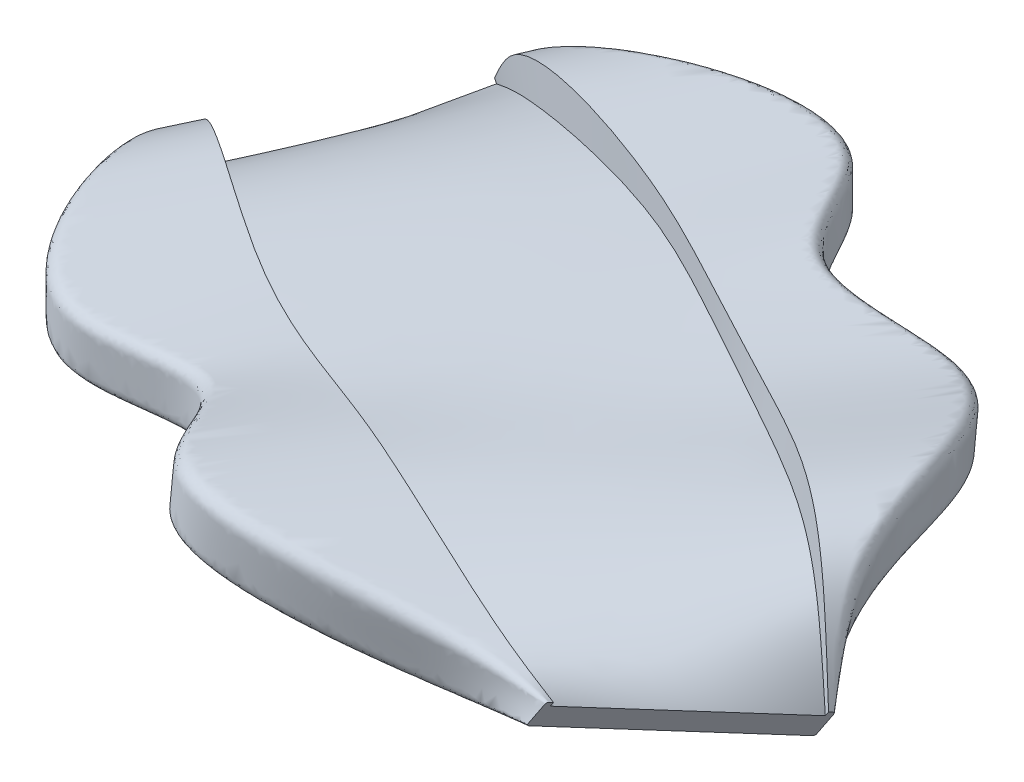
ISO-10303-21;
HEADER;
FILE_DESCRIPTION(('STEP AP214'),'2;1');
FILE_NAME('part.step','',(''),(''),'','','');
FILE_SCHEMA(('AUTOMOTIVE_DESIGN { 1 0 10303 214 1 1 1 1 }'));
ENDSEC;
DATA;
#1=APPLICATION_CONTEXT('core data for automotive mechanical design processes');
#2=APPLICATION_PROTOCOL_DEFINITION('international standard','automotive_design',2000,#1);
#3=PRODUCT_CONTEXT('',#1,'mechanical');
#4=PRODUCT('Part','Part','',(#3));
#5=PRODUCT_RELATED_PRODUCT_CATEGORY('part','',(#4));
#6=PRODUCT_DEFINITION_FORMATION('','',#4);
#7=PRODUCT_DEFINITION_CONTEXT('part definition',#1,'design');
#8=PRODUCT_DEFINITION('design','',#6,#7);
#9=PRODUCT_DEFINITION_SHAPE('','',#8);
#10=(LENGTH_UNIT() NAMED_UNIT(*) SI_UNIT(.MILLI.,.METRE.));
#11=(NAMED_UNIT(*) PLANE_ANGLE_UNIT() SI_UNIT($,.RADIAN.));
#12=(NAMED_UNIT(*) SI_UNIT($,.STERADIAN.) SOLID_ANGLE_UNIT());
#13=UNCERTAINTY_MEASURE_WITH_UNIT(LENGTH_MEASURE(1.E-05),#10,'distance_accuracy_value','');
#14=(GEOMETRIC_REPRESENTATION_CONTEXT(3) GLOBAL_UNCERTAINTY_ASSIGNED_CONTEXT((#13)) GLOBAL_UNIT_ASSIGNED_CONTEXT((#10,
#11,#12)) REPRESENTATION_CONTEXT('',''));
#15=CARTESIAN_POINT('',(0.,0.,0.));
#16=DIRECTION('',(0.,0.,1.));
#17=DIRECTION('',(1.,0.,0.));
#18=AXIS2_PLACEMENT_3D('',#15,#16,#17);
#19=CARTESIAN_POINT('',(-95.3601132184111,25.3491724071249,-45.8065123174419));
#20=DIRECTION('',(-0.819577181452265,-0.405666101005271,-0.404633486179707));
#21=DIRECTION('',(0.443603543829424,-0.896223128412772,0.));
#22=AXIS2_PLACEMENT_3D('',#19,#20,#21);
#23=PLANE('',#22);
#24=DIRECTION('',(-0.431351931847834,0.901675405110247,-0.0302815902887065));
#25=VECTOR('',#24,1.);
#26=CARTESIAN_POINT('',(-85.7468293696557,29.4381637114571,-69.3774563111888));
#27=LINE('',#26,#25);
#28=CARTESIAN_POINT('',(-85.527702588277,28.9801126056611,-69.3620732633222));
#29=VERTEX_POINT('',#28);
#30=CARTESIAN_POINT('',(-85.7468293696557,29.4381637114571,-69.3774563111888));
#31=VERTEX_POINT('',#30);
#32=EDGE_CURVE('E135',#29,#31,#27,.T.);
#33=ORIENTED_EDGE('',*,*,#32,.T.);
#34=DIRECTION('',(0.377132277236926,0.149721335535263,-0.913977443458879));
#35=VECTOR('',#34,1.);
#36=CARTESIAN_POINT('',(-85.6031419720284,29.495207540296,-69.7256817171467));
#37=LINE('',#36,#35);
#38=CARTESIAN_POINT('',(-85.6031419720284,29.495207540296,-69.7256817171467));
#39=VERTEX_POINT('',#38);
#40=EDGE_CURVE('E141',#31,#39,#37,.T.);
#41=ORIENTED_EDGE('',*,*,#40,.T.);
#42=CARTESIAN_POINT('',(-85.4935785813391,29.266181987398,-69.7179901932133));
#43=DIRECTION('',(-0.819577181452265,-0.405666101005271,-0.404633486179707));
#44=DIRECTION('',(0.443603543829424,-0.896223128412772,0.));
#45=AXIS2_PLACEMENT_3D('',#42,#43,#44);
#46=CIRCLE('',#45,0.253999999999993);
#47=CARTESIAN_POINT('',(-85.3977869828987,29.3042112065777,-69.9501404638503));
#48=VERTEX_POINT('',#47);
#49=EDGE_CURVE('E125',#39,#48,#46,.T.);
#50=ORIENTED_EDGE('',*,*,#49,.T.);
#51=DIRECTION('',(0.431351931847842,-0.901675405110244,0.0302815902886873));
#52=VECTOR('',#51,1.);
#53=CARTESIAN_POINT('',(-84.2254587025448,26.8536377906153,-69.8678411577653));
#54=LINE('',#53,#52);
#55=CARTESIAN_POINT('',(-84.2254587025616,26.8536377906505,-69.8678411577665));
#56=VERTEX_POINT('',#55);
#57=EDGE_CURVE('E225',#48,#56,#54,.T.);
#58=ORIENTED_EDGE('',*,*,#57,.T.);
#59=CARTESIAN_POINT('',(-84.321250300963,26.8156085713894,-69.6356908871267));
#60=DIRECTION('',(-0.819577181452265,-0.405666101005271,-0.404633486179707));
#61=DIRECTION('',(0.443603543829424,-0.896223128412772,0.));
#62=AXIS2_PLACEMENT_3D('',#59,#60,#61);
#63=CIRCLE('',#62,0.253999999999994);
#64=CARTESIAN_POINT('',(-84.2116869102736,26.5865830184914,-69.6279993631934));
#65=VERTEX_POINT('',#64);
#66=EDGE_CURVE('E230',#56,#65,#63,.T.);
#67=ORIENTED_EDGE('',*,*,#66,.T.);
#68=DIRECTION('',(-0.37713227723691,-0.149721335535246,0.913977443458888));
#69=VECTOR('',#68,1.);
#70=CARTESIAN_POINT('',(-94.0782215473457,22.6695734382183,-45.716521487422));
#71=LINE('',#70,#69);
#72=CARTESIAN_POINT('',(-94.0782215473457,22.6695734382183,-45.716521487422));
#73=VERTEX_POINT('',#72);
#74=EDGE_CURVE('E235',#65,#73,#71,.T.);
#75=ORIENTED_EDGE('',*,*,#74,.T.);
#76=CARTESIAN_POINT('',(-94.187784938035,22.8985989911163,-45.7242130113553));
#77=DIRECTION('',(-0.819577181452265,-0.405666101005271,-0.404633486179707));
#78=DIRECTION('',(0.443603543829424,-0.896223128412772,0.));
#79=AXIS2_PLACEMENT_3D('',#76,#77,#78);
#80=CIRCLE('',#79,0.253999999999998);
#81=CARTESIAN_POINT('',(-94.2835765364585,22.8605697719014,-45.4920627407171));
#82=VERTEX_POINT('',#81);
#83=EDGE_CURVE('E240',#73,#82,#80,.T.);
#84=ORIENTED_EDGE('',*,*,#83,.T.);
#85=DIRECTION('',(-0.431351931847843,0.901675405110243,-0.0302815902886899));
#86=VECTOR('',#85,1.);
#87=CARTESIAN_POINT('',(-95.4559048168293,25.311143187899,-45.5743620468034));
#88=LINE('',#87,#86);
#89=CARTESIAN_POINT('',(-95.4559048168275,25.3111431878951,-45.5743620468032));
#90=VERTEX_POINT('',#89);
#91=EDGE_CURVE('E245',#82,#90,#88,.T.);
#92=ORIENTED_EDGE('',*,*,#91,.T.);
#93=CARTESIAN_POINT('',(-95.3601132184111,25.3491724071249,-45.8065123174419));
#94=DIRECTION('',(-0.819577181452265,-0.405666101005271,-0.404633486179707));
#95=DIRECTION('',(0.443603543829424,-0.896223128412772,0.));
#96=AXIS2_PLACEMENT_3D('',#93,#94,#95);
#97=CIRCLE('',#96,0.254000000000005);
#98=CARTESIAN_POINT('',(-95.4696766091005,25.5781979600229,-45.814203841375));
#99=VERTEX_POINT('',#98);
#100=EDGE_CURVE('E250',#90,#99,#97,.T.);
#101=ORIENTED_EDGE('',*,*,#100,.T.);
#102=DIRECTION('',(0.377132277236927,0.149721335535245,-0.913977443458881));
#103=VECTOR('',#102,1.);
#104=CARTESIAN_POINT('',(-95.3259892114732,25.6352417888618,-46.1624292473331));
#105=LINE('',#104,#103);
#106=CARTESIAN_POINT('',(-95.3259892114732,25.6352417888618,-46.1624292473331));
#107=VERTEX_POINT('',#106);
#108=EDGE_CURVE('E255',#99,#107,#105,.T.);
#109=ORIENTED_EDGE('',*,*,#108,.T.);
#110=DIRECTION('',(0.431351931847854,-0.901675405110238,0.0302815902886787));
#111=VECTOR('',#110,1.);
#112=CARTESIAN_POINT('',(-95.1068624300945,25.1771906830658,-46.1470461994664));
#113=LINE('',#112,#111);
#114=CARTESIAN_POINT('',(-95.1068624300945,25.1771906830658,-46.1470461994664));
#115=VERTEX_POINT('',#114);
#116=EDGE_CURVE('E260',#107,#115,#113,.T.);
#117=ORIENTED_EDGE('',*,*,#116,.T.);
#118=DIRECTION('',(0.37713227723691,0.149721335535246,-0.913977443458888));
#119=VECTOR('',#118,1.);
#120=CARTESIAN_POINT('',(-85.527702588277,28.9801126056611,-69.3620732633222));
#121=LINE('',#120,#119);
#122=EDGE_CURVE('E154',#115,#29,#121,.T.);
#123=ORIENTED_EDGE('',*,*,#122,.T.);
#124=EDGE_LOOP('',(#33,#41,#50,#58,#67,#75,#84,#92,#101,#109,#117,#123));
#125=FACE_BOUND('',#124,.T.);
#126=ADVANCED_FACE('F38',(#125),#23,.T.);
#127=CARTESIAN_POINT('',(-12.5880422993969,25.0219433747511,-32.5078543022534));
#128=DIRECTION('',(0.819577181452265,-0.405666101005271,0.404633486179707));
#129=DIRECTION('',(0.443603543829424,0.896223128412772,0.));
#130=AXIS2_PLACEMENT_3D('',#127,#128,#129);
#131=PLANE('',#130);
#132=DIRECTION('',(0.505132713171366,0.844885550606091,-0.176094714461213));
#133=VECTOR('',#132,1.);
#134=CARTESIAN_POINT('',(-19.4317802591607,34.2268126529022,-9.41763755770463));
#135=LINE('',#134,#133);
#136=CARTESIAN_POINT('',(-19.6883876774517,33.7976107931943,-9.32818144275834));
#137=VERTEX_POINT('',#136);
#138=CARTESIAN_POINT('',(-19.4317802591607,34.2268126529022,-9.41763755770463));
#139=VERTEX_POINT('',#138);
#140=EDGE_CURVE('E214',#137,#139,#135,.T.);
#141=ORIENTED_EDGE('',*,*,#140,.T.);
#142=DIRECTION('',(-0.270433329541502,0.348716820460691,0.897364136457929));
#143=VECTOR('',#142,1.);
#144=CARTESIAN_POINT('',(-19.534815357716,34.3596737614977,-9.07574182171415));
#145=LINE('',#144,#143);
#146=CARTESIAN_POINT('',(-19.534815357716,34.3596737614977,-9.07574182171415));
#147=VERTEX_POINT('',#146);
#148=EDGE_CURVE('E11',#139,#147,#145,.T.);
#149=ORIENTED_EDGE('',*,*,#148,.T.);
#150=CARTESIAN_POINT('',(-19.6631190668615,34.1450728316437,-9.03101376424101));
#151=DIRECTION('',(0.819577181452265,-0.405666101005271,0.404633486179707));
#152=DIRECTION('',(0.443603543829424,0.896223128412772,0.));
#153=AXIS2_PLACEMENT_3D('',#150,#151,#152);
#154=CIRCLE('',#153,0.254000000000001);
#155=CARTESIAN_POINT('',(-19.731809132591,34.2336469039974,-8.80308327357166));
#156=VERTEX_POINT('',#155);
#157=EDGE_CURVE('E48',#147,#156,#154,.T.);
#158=ORIENTED_EDGE('',*,*,#157,.T.);
#159=DIRECTION('',(-0.505132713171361,-0.844885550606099,0.176094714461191));
#160=VECTOR('',#159,1.);
#161=CARTESIAN_POINT('',(-21.1046588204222,31.9374169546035,-8.32449305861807));
#162=LINE('',#161,#160);
#163=CARTESIAN_POINT('',(-21.1046588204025,31.9374169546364,-8.32449305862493));
#164=VERTEX_POINT('',#163);
#165=EDGE_CURVE('E172',#156,#164,#162,.T.);
#166=ORIENTED_EDGE('',*,*,#165,.T.);
#167=CARTESIAN_POINT('',(-21.0359687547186,31.8488428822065,-8.55242354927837));
#168=DIRECTION('',(0.819577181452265,-0.405666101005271,0.404633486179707));
#169=DIRECTION('',(0.443603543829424,0.896223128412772,0.));
#170=AXIS2_PLACEMENT_3D('',#167,#168,#169);
#171=CIRCLE('',#170,0.25399999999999);
#172=CARTESIAN_POINT('',(-21.1642724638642,31.6342419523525,-8.50769549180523));
#173=VERTEX_POINT('',#172);
#174=EDGE_CURVE('E177',#164,#173,#171,.T.);
#175=ORIENTED_EDGE('',*,*,#174,.T.);
#176=DIRECTION('',(0.270433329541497,-0.348716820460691,-0.89736413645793));
#177=VECTOR('',#176,1.);
#178=CARTESIAN_POINT('',(-14.0891956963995,22.5111124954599,-31.9845360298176));
#179=LINE('',#178,#177);
#180=CARTESIAN_POINT('',(-14.0891956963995,22.5111124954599,-31.9845360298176));
#181=VERTEX_POINT('',#180);
#182=EDGE_CURVE('E182',#173,#181,#179,.T.);
#183=ORIENTED_EDGE('',*,*,#182,.T.);
#184=CARTESIAN_POINT('',(-13.960891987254,22.7257134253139,-32.0292640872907));
#185=DIRECTION('',(0.819577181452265,-0.405666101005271,0.404633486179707));
#186=DIRECTION('',(0.443603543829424,0.896223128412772,0.));
#187=AXIS2_PLACEMENT_3D('',#184,#185,#186);
#188=CIRCLE('',#187,0.254);
#189=CARTESIAN_POINT('',(-13.8922019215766,22.6371393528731,-32.2571945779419));
#190=VERTEX_POINT('',#189);
#191=EDGE_CURVE('E187',#181,#190,#188,.T.);
#192=ORIENTED_EDGE('',*,*,#191,.T.);
#193=DIRECTION('',(0.505132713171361,0.844885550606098,-0.176094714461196));
#194=VECTOR('',#193,1.);
#195=CARTESIAN_POINT('',(-12.5193522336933,24.9333693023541,-32.7357847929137));
#196=LINE('',#195,#194);
#197=CARTESIAN_POINT('',(-12.5193522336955,24.9333693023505,-32.735784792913));
#198=VERTEX_POINT('',#197);
#199=EDGE_CURVE('E192',#190,#198,#196,.T.);
#200=ORIENTED_EDGE('',*,*,#199,.T.);
#201=CARTESIAN_POINT('',(-12.5880422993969,25.0219433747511,-32.5078543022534));
#202=DIRECTION('',(0.819577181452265,-0.405666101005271,0.404633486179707));
#203=DIRECTION('',(0.443603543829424,0.896223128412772,0.));
#204=AXIS2_PLACEMENT_3D('',#201,#202,#203);
#205=CIRCLE('',#204,0.254);
#206=CARTESIAN_POINT('',(-12.4597385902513,25.236544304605,-32.5525823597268));
#207=VERTEX_POINT('',#206);
#208=EDGE_CURVE('E197',#198,#207,#205,.T.);
#209=ORIENTED_EDGE('',*,*,#208,.T.);
#210=DIRECTION('',(-0.27043332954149,0.348716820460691,0.897364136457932));
#211=VECTOR('',#210,1.);
#212=CARTESIAN_POINT('',(-12.5627736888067,25.3694054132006,-32.2106866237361));
#213=LINE('',#212,#211);
#214=CARTESIAN_POINT('',(-12.5627736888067,25.3694054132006,-32.2106866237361));
#215=VERTEX_POINT('',#214);
#216=EDGE_CURVE('E202',#207,#215,#213,.T.);
#217=ORIENTED_EDGE('',*,*,#216,.T.);
#218=DIRECTION('',(-0.505132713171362,-0.844885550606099,0.176094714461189));
#219=VECTOR('',#218,1.);
#220=CARTESIAN_POINT('',(-12.8193811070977,24.9402035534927,-32.1212305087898));
#221=LINE('',#220,#219);
#222=CARTESIAN_POINT('',(-12.8193811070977,24.9402035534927,-32.1212305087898));
#223=VERTEX_POINT('',#222);
#224=EDGE_CURVE('E138',#215,#223,#221,.T.);
#225=ORIENTED_EDGE('',*,*,#224,.T.);
#226=DIRECTION('',(-0.270433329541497,0.348716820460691,0.89736413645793));
#227=VECTOR('',#226,1.);
#228=CARTESIAN_POINT('',(-19.6883876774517,33.7976107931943,-9.32818144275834));
#229=LINE('',#228,#227);
#230=EDGE_CURVE('E209',#223,#137,#229,.T.);
#231=ORIENTED_EDGE('',*,*,#230,.T.);
#232=EDGE_LOOP('',(#141,#149,#158,#166,#175,#183,#192,#200,#209,#217,#225,#231));
#233=FACE_BOUND('',#232,.T.);
#234=ADVANCED_FACE('F364',(#233),#131,.T.);
#235=CARTESIAN_POINT('',(-12.8193811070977,24.9402035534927,-32.1212305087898));
#236=CARTESIAN_POINT('',(-13.9062072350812,27.3789482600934,-32.9912492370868));
#237=CARTESIAN_POINT('',(-18.3203900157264,37.2839961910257,-36.5248610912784));
#238=CARTESIAN_POINT('',(-32.0232734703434,31.8245731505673,-46.7120631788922));
#239=CARTESIAN_POINT('',(-46.7605291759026,35.5106340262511,-53.2640525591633));
#240=CARTESIAN_POINT('',(-61.5182462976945,34.5685718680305,-61.6000427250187));
#241=CARTESIAN_POINT('',(-76.4658597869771,35.1044987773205,-63.9771721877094));
#242=CARTESIAN_POINT('',(-83.8189569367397,30.1349569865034,-68.3466698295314));
#243=CARTESIAN_POINT('',(-85.527702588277,28.9801126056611,-69.3620732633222));
#244=CARTESIAN_POINT('',(-19.6883876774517,33.7976107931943,-9.32818144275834));
#245=CARTESIAN_POINT('',(-22.3165007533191,33.0125931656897,-10.2919440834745));
#246=CARTESIAN_POINT('',(-32.9906750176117,29.8242162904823,-14.2063001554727));
#247=CARTESIAN_POINT('',(-45.8998002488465,38.490826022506,-17.1780629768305));
#248=CARTESIAN_POINT('',(-60.7880877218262,34.3248998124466,-25.2005227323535));
#249=CARTESIAN_POINT('',(-75.9110763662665,34.9101099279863,-31.8242635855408));
#250=CARTESIAN_POINT('',(-88.5938670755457,37.0193786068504,-41.9822894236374));
#251=CARTESIAN_POINT('',(-93.8787399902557,27.4102118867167,-45.3617191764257));
#252=CARTESIAN_POINT('',(-95.1068624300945,25.1771906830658,-46.1470461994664));
#253=B_SPLINE_SURFACE_WITH_KNOTS('',1,3,((#235,#236,#237,#238,#239,#240,#241,#242,#243),(#244,
#245,#246,#247,#248,#249,#250,#251,#252)),.UNSPECIFIED.,.F.,.F.,.F.,(2,2),(4,1,1,1,1,1,4),(0.,
1.),(0.,0.089070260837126,0.361762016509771,0.504161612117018,0.644982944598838,
0.917499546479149,1.),.UNSPECIFIED.);
#254=CARTESIAN_POINT('',(-12.8193811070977,24.9402035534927,-32.1212305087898));
#255=CARTESIAN_POINT('',(-13.9062072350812,27.3789482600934,-32.9912492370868));
#256=CARTESIAN_POINT('',(-18.3203900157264,37.2839961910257,-36.5248610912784));
#257=CARTESIAN_POINT('',(-32.0232734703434,31.8245731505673,-46.7120631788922));
#258=CARTESIAN_POINT('',(-46.7605291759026,35.5106340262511,-53.2640525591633));
#259=CARTESIAN_POINT('',(-61.5182462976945,34.5685718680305,-61.6000427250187));
#260=CARTESIAN_POINT('',(-76.4658597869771,35.1044987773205,-63.9771721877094));
#261=CARTESIAN_POINT('',(-83.8189569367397,30.1349569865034,-68.3466698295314));
#262=CARTESIAN_POINT('',(-85.527702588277,28.9801126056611,-69.3620732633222));
#263=B_SPLINE_CURVE_WITH_KNOTS('',3,(#254,#255,#256,#257,#258,#259,#260,#261,#262),
.UNSPECIFIED.,.F.,.F.,(4,1,1,1,1,1,4),(0.,0.089070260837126,0.361762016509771,0.504161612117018,
0.644982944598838,0.917499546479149,1.),.UNSPECIFIED.);
#264=EDGE_CURVE('E596',#29,#223,#263,.F.);
#265=CARTESIAN_POINT('',(-19.6883876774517,33.7976107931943,-9.32818144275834));
#266=CARTESIAN_POINT('',(-22.3165007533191,33.0125931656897,-10.2919440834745));
#267=CARTESIAN_POINT('',(-32.9906750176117,29.8242162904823,-14.2063001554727));
#268=CARTESIAN_POINT('',(-45.8998002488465,38.490826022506,-17.1780629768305));
#269=CARTESIAN_POINT('',(-60.7880877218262,34.3248998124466,-25.2005227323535));
#270=CARTESIAN_POINT('',(-75.9110763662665,34.9101099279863,-31.8242635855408));
#271=CARTESIAN_POINT('',(-88.5938670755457,37.0193786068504,-41.9822894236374));
#272=CARTESIAN_POINT('',(-93.8787399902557,27.4102118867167,-45.3617191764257));
#273=CARTESIAN_POINT('',(-95.1068624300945,25.1771906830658,-46.1470461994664));
#274=B_SPLINE_CURVE_WITH_KNOTS('',3,(#265,#266,#267,#268,#269,#270,#271,#272,#273),
.UNSPECIFIED.,.F.,.F.,(4,1,1,1,1,1,4),(0.,0.089070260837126,0.361762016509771,0.504161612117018,
0.644982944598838,0.917499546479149,1.),.UNSPECIFIED.);
#275=EDGE_CURVE('E219',#137,#115,#274,.T.);
#276=ORIENTED_EDGE('',*,*,#230,.F.);
#277=ORIENTED_EDGE('',*,*,#264,.F.);
#278=ORIENTED_EDGE('',*,*,#122,.F.);
#279=ORIENTED_EDGE('',*,*,#275,.F.);
#280=EDGE_LOOP('',(#276,#277,#278,#279));
#281=FACE_BOUND('',#280,.T.);
#282=ADVANCED_FACE('F373',(#281),#253,.F.);
#283=CARTESIAN_POINT('',(-19.6883876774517,33.7976107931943,-9.32818144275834));
#284=CARTESIAN_POINT('',(-22.3165007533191,33.0125931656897,-10.2919440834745));
#285=CARTESIAN_POINT('',(-32.9906750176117,29.8242162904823,-14.2063001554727));
#286=CARTESIAN_POINT('',(-45.8998002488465,38.490826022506,-17.1780629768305));
#287=CARTESIAN_POINT('',(-60.7880877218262,34.3248998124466,-25.2005227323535));
#288=CARTESIAN_POINT('',(-75.9110763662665,34.9101099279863,-31.8242635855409));
#289=CARTESIAN_POINT('',(-88.5938670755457,37.0193786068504,-41.9822894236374));
#290=CARTESIAN_POINT('',(-93.8787399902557,27.4102118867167,-45.3617191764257));
#291=CARTESIAN_POINT('',(-95.1068624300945,25.1771906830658,-46.1470461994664));
#292=CARTESIAN_POINT('',(-19.4317802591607,34.2268126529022,-9.41763755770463));
#293=CARTESIAN_POINT('',(-21.8158293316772,34.4321743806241,-10.2030002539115));
#294=CARTESIAN_POINT('',(-31.4987290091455,35.2662583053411,-13.3927786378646));
#295=CARTESIAN_POINT('',(-45.9100201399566,41.1724504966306,-17.7938242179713));
#296=CARTESIAN_POINT('',(-60.8381238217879,37.6700494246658,-25.1052117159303));
#297=CARTESIAN_POINT('',(-75.6116549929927,37.5832403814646,-31.7735849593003));
#298=CARTESIAN_POINT('',(-90.2212986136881,42.6338691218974,-42.6045035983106));
#299=CARTESIAN_POINT('',(-94.3634236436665,28.8405865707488,-45.4915292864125));
#300=CARTESIAN_POINT('',(-95.3259892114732,25.6352417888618,-46.1624292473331));
#301=B_SPLINE_SURFACE_WITH_KNOTS('',1,3,((#283,#284,#285,#286,#287,#288,#289,#290,#291),(#292,
#293,#294,#295,#296,#297,#298,#299,#300)),.UNSPECIFIED.,.F.,.F.,.F.,(2,2),(4,1,1,1,1,1,4),(0.,
1.),(0.,0.089070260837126,0.361762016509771,0.504161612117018,0.644982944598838,
0.917499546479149,1.),.UNSPECIFIED.);
#302=CARTESIAN_POINT('',(-19.4317802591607,34.2268126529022,-9.41763755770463));
#303=CARTESIAN_POINT('',(-21.8158293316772,34.4321743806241,-10.2030002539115));
#304=CARTESIAN_POINT('',(-31.4987290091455,35.2662583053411,-13.3927786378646));
#305=CARTESIAN_POINT('',(-45.9100201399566,41.1724504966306,-17.7938242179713));
#306=CARTESIAN_POINT('',(-60.8381238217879,37.6700494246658,-25.1052117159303));
#307=CARTESIAN_POINT('',(-75.6116549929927,37.5832403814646,-31.7735849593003));
#308=CARTESIAN_POINT('',(-90.2212986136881,42.6338691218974,-42.6045035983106));
#309=CARTESIAN_POINT('',(-94.3634236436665,28.8405865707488,-45.4915292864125));
#310=CARTESIAN_POINT('',(-95.3259892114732,25.6352417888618,-46.1624292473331));
#311=B_SPLINE_CURVE_WITH_KNOTS('',3,(#302,#303,#304,#305,#306,#307,#308,#309,#310),
.UNSPECIFIED.,.F.,.F.,(4,1,1,1,1,1,4),(0.,0.089070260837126,0.361762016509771,0.504161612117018,
0.644982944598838,0.917499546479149,1.),.UNSPECIFIED.);
#312=EDGE_CURVE('E57',#139,#107,#311,.T.);
#313=ORIENTED_EDGE('',*,*,#140,.F.);
#314=ORIENTED_EDGE('',*,*,#275,.T.);
#315=ORIENTED_EDGE('',*,*,#116,.F.);
#316=ORIENTED_EDGE('',*,*,#312,.F.);
#317=EDGE_LOOP('',(#313,#314,#315,#316));
#318=FACE_BOUND('',#317,.T.);
#319=ADVANCED_FACE('F442',(#318),#301,.F.);
#320=CARTESIAN_POINT('',(-12.5627736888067,25.3694054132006,-32.2106866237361));
#321=CARTESIAN_POINT('',(-13.4055358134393,28.7985294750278,-32.9023054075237));
#322=CARTESIAN_POINT('',(-16.8284440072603,42.7260382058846,-35.7113395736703));
#323=CARTESIAN_POINT('',(-32.0334933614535,34.5061976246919,-47.327824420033));
#324=CARTESIAN_POINT('',(-46.8105652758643,38.8557836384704,-53.1687415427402));
#325=CARTESIAN_POINT('',(-61.2188249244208,37.2417023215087,-61.5493640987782));
#326=CARTESIAN_POINT('',(-78.0932913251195,40.7189892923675,-64.5993863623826));
#327=CARTESIAN_POINT('',(-84.3036405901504,31.5653316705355,-68.4764799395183));
#328=CARTESIAN_POINT('',(-85.7468293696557,29.4381637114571,-69.3774563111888));
#329=CARTESIAN_POINT('',(-12.8193811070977,24.9402035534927,-32.1212305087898));
#330=CARTESIAN_POINT('',(-13.9062072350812,27.3789482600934,-32.9912492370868));
#331=CARTESIAN_POINT('',(-18.3203900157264,37.2839961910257,-36.5248610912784));
#332=CARTESIAN_POINT('',(-32.0232734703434,31.8245731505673,-46.7120631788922));
#333=CARTESIAN_POINT('',(-46.7605291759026,35.5106340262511,-53.2640525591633));
#334=CARTESIAN_POINT('',(-61.5182462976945,34.5685718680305,-61.6000427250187));
#335=CARTESIAN_POINT('',(-76.4658597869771,35.1044987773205,-63.9771721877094));
#336=CARTESIAN_POINT('',(-83.8189569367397,30.1349569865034,-68.3466698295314));
#337=CARTESIAN_POINT('',(-85.527702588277,28.9801126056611,-69.3620732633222));
#338=B_SPLINE_SURFACE_WITH_KNOTS('',1,3,((#320,#321,#322,#323,#324,#325,#326,#327,#328),(#329,
#330,#331,#332,#333,#334,#335,#336,#337)),.UNSPECIFIED.,.F.,.F.,.F.,(2,2),(4,1,1,1,1,1,4),(0.,
1.),(0.,0.089070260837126,0.361762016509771,0.504161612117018,0.644982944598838,
0.917499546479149,1.),.UNSPECIFIED.);
#339=CARTESIAN_POINT('',(-12.5627736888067,25.3694054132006,-32.2106866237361));
#340=CARTESIAN_POINT('',(-13.4055358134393,28.7985294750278,-32.9023054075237));
#341=CARTESIAN_POINT('',(-16.8284440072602,42.7260382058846,-35.7113395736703));
#342=CARTESIAN_POINT('',(-32.0334933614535,34.5061976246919,-47.327824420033));
#343=CARTESIAN_POINT('',(-46.8105652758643,38.8557836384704,-53.1687415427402));
#344=CARTESIAN_POINT('',(-61.2188249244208,37.2417023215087,-61.5493640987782));
#345=CARTESIAN_POINT('',(-78.0932913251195,40.7189892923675,-64.5993863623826));
#346=CARTESIAN_POINT('',(-84.3036405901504,31.5653316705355,-68.4764799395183));
#347=CARTESIAN_POINT('',(-85.7468293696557,29.4381637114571,-69.3774563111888));
#348=B_SPLINE_CURVE_WITH_KNOTS('',3,(#339,#340,#341,#342,#343,#344,#345,#346,#347),
.UNSPECIFIED.,.F.,.F.,(4,1,1,1,1,1,4),(0.,0.089070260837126,0.361762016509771,0.504161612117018,
0.644982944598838,0.917499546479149,1.),.UNSPECIFIED.);
#349=EDGE_CURVE('E132',#215,#31,#348,.T.);
#350=ORIENTED_EDGE('',*,*,#224,.F.);
#351=ORIENTED_EDGE('',*,*,#349,.T.);
#352=ORIENTED_EDGE('',*,*,#32,.F.);
#353=ORIENTED_EDGE('',*,*,#264,.T.);
#354=EDGE_LOOP('',(#350,#351,#352,#353));
#355=FACE_BOUND('',#354,.T.);
#356=ADVANCED_FACE('F133',(#355),#338,.F.);
#357=CARTESIAN_POINT('',(-19.4317802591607,34.2268126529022,-9.41763755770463));
#358=CARTESIAN_POINT('',(-21.8158293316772,34.432174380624,-10.2030002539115));
#359=CARTESIAN_POINT('',(-31.4987290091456,35.2662583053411,-13.3927786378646));
#360=CARTESIAN_POINT('',(-45.9100201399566,41.1724504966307,-17.7938242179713));
#361=CARTESIAN_POINT('',(-60.8381238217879,37.6700494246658,-25.1052117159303));
#362=CARTESIAN_POINT('',(-75.6116549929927,37.5832403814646,-31.7735849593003));
#363=CARTESIAN_POINT('',(-90.2212986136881,42.6338691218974,-42.6045035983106));
#364=CARTESIAN_POINT('',(-94.3634236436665,28.8405865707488,-45.4915292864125));
#365=CARTESIAN_POINT('',(-95.3259892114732,25.6352417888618,-46.1624292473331));
#366=CARTESIAN_POINT('',(-19.4403665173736,34.2378844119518,-9.38914624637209));
#367=CARTESIAN_POINT('',(-21.8339215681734,34.4369649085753,-10.1584521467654));
#368=CARTESIAN_POINT('',(-31.5554301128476,35.2455373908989,-13.2830152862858));
#369=CARTESIAN_POINT('',(-46.7593755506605,41.3802405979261,-16.0725875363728));
#370=CARTESIAN_POINT('',(-60.9557406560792,37.6309118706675,-24.8670459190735));
#371=CARTESIAN_POINT('',(-76.464783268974,37.6064829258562,-30.0460798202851));
#372=CARTESIAN_POINT('',(-90.2834228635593,42.625333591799,-42.4755221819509));
#373=CARTESIAN_POINT('',(-94.3848541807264,28.8351197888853,-45.4436610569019));
#374=CARTESIAN_POINT('',(-95.3379631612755,25.6304881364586,-46.1334104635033));
#375=CARTESIAN_POINT('',(-19.4562328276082,34.2583436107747,-9.33649793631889));
#376=CARTESIAN_POINT('',(-21.8635231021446,34.4449724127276,-10.0838917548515));
#377=CARTESIAN_POINT('',(-31.640817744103,35.2029718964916,-13.1194581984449));
#378=CARTESIAN_POINT('',(-48.5519951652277,41.8134155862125,-12.4400382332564));
#379=CARTESIAN_POINT('',(-61.1723849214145,37.5493739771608,-24.4283569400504));
#380=CARTESIAN_POINT('',(-78.2653202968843,37.6546398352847,-26.4000318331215));
#381=CARTESIAN_POINT('',(-90.3802913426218,42.6091443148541,-42.2734962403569));
#382=CARTESIAN_POINT('',(-94.4210742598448,28.8249392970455,-45.3620544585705));
#383=CARTESIAN_POINT('',(-95.3600894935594,25.621703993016,-46.0797874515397));
#384=CARTESIAN_POINT('',(-19.478767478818,34.2874014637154,-9.26172243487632));
#385=CARTESIAN_POINT('',(-21.9017726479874,34.4555050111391,-9.98567756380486));
#386=CARTESIAN_POINT('',(-31.7428938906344,35.13826351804,-12.9260469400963));
#387=CARTESIAN_POINT('',(-51.3189513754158,42.477592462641,-6.83330276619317));
#388=CARTESIAN_POINT('',(-61.4811876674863,37.4243990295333,-23.8030530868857));
#389=CARTESIAN_POINT('',(-81.0444583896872,37.7282164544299,-20.7722267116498));
#390=CARTESIAN_POINT('',(-90.5001187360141,42.585736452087,-42.0225211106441));
#391=CARTESIAN_POINT('',(-94.4691693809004,28.8104019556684,-45.2529305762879));
#392=CARTESIAN_POINT('',(-95.3915151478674,25.6092280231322,-46.0036275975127));
#393=CARTESIAN_POINT('',(-19.5032700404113,34.3189968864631,-9.18041692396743));
#394=CARTESIAN_POINT('',(-21.9506362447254,34.4685369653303,-9.86415359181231));
#395=CARTESIAN_POINT('',(-31.8907006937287,35.0758992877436,-12.6411742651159));
#396=CARTESIAN_POINT('',(-53.9038693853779,43.107766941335,-1.59507949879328));
#397=CARTESIAN_POINT('',(-61.8297805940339,37.3057435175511,-23.0971698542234));
#398=CARTESIAN_POINT('',(-83.6408300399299,37.7984811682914,-15.5147236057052));
#399=CARTESIAN_POINT('',(-90.6644551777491,42.5610635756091,-41.6806718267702));
#400=CARTESIAN_POINT('',(-94.5278842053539,28.7947420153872,-45.1212742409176));
#401=CARTESIAN_POINT('',(-95.4256851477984,25.595662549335,-45.9208168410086));
#402=CARTESIAN_POINT('',(-19.5215277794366,34.3425397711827,-9.11983326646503));
#403=CARTESIAN_POINT('',(-21.9941881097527,34.4797990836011,-9.75913605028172));
#404=CARTESIAN_POINT('',(-32.0369855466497,35.0372826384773,-12.3556869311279));
#405=CARTESIAN_POINT('',(-55.413998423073,43.4869610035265,1.46553689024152));
#406=CARTESIAN_POINT('',(-62.1018247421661,37.2342565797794,-22.546287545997));
#407=CARTESIAN_POINT('',(-85.1577339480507,37.8412734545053,-12.443305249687));
#408=CARTESIAN_POINT('',(-90.8203353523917,42.5434442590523,-41.3582415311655));
#409=CARTESIAN_POINT('',(-94.5779379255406,28.7832175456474,-45.0104053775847));
#410=CARTESIAN_POINT('',(-95.4511464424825,25.5855544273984,-45.8591115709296));
#411=CARTESIAN_POINT('',(-19.535887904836,34.3610567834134,-9.07218284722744));
#412=CARTESIAN_POINT('',(-22.036063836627,34.4904567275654,-9.6611007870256));
#413=CARTESIAN_POINT('',(-32.190616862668,35.0160191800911,-12.0530118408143));
#414=CARTESIAN_POINT('',(-56.1578422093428,43.6803778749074,2.97365628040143));
#415=CARTESIAN_POINT('',(-62.2614479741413,37.1976658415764,-22.2230821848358));
#416=CARTESIAN_POINT('',(-85.9050076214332,37.8638361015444,-10.9305356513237));
#417=CARTESIAN_POINT('',(-90.9786111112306,42.5304740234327,-41.0323889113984));
#418=CARTESIAN_POINT('',(-94.6240328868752,28.7743206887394,-44.9095799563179));
#419=CARTESIAN_POINT('',(-95.4711723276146,25.5776041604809,-45.8105789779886));
#420=CARTESIAN_POINT('',(-19.5381026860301,34.3638251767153,-9.06492139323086));
#421=CARTESIAN_POINT('',(-22.043441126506,34.4921847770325,-9.64446981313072));
#422=CARTESIAN_POINT('',(-32.2189618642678,35.0135218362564,-11.9983262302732));
#423=CARTESIAN_POINT('',(-56.2401977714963,43.6774435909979,3.1409251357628));
#424=CARTESIAN_POINT('',(-62.2939996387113,37.1937197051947,-22.1571574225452));
#425=CARTESIAN_POINT('',(-85.9869296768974,37.8401387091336,-10.7650069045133));
#426=CARTESIAN_POINT('',(-91.0063352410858,42.5282965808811,-40.9737934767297));
#427=CARTESIAN_POINT('',(-94.6317129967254,28.772885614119,-44.8925367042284));
#428=CARTESIAN_POINT('',(-95.4741945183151,25.5763416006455,-45.8031918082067));
#429=CARTESIAN_POINT('',(-19.5418284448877,34.367743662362,-9.05344645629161));
#430=CARTESIAN_POINT('',(-22.057310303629,34.4937359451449,-9.61498034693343));
#431=CARTESIAN_POINT('',(-32.2740288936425,35.0054580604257,-11.8956701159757));
#432=CARTESIAN_POINT('',(-56.3295108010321,43.6425846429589,3.3233011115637));
#433=CARTESIAN_POINT('',(-62.3502037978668,37.1742437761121,-22.0433038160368));
#434=CARTESIAN_POINT('',(-86.0748090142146,37.7800686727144,-10.5885265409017));
#435=CARTESIAN_POINT('',(-91.0564567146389,42.5190186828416,-40.8632220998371));
#436=CARTESIAN_POINT('',(-94.644834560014,28.769163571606,-44.8622748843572));
#437=CARTESIAN_POINT('',(-95.478717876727,25.5739106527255,-45.7915926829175));
#438=CARTESIAN_POINT('',(-19.5461523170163,34.3711868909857,-9.041236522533));
#439=CARTESIAN_POINT('',(-22.0741249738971,34.493688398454,-9.58093699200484));
#440=CARTESIAN_POINT('',(-32.3415753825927,34.9912326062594,-11.7729495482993));
#441=CARTESIAN_POINT('',(-56.3956029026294,43.5903827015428,3.45949876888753));
#442=CARTESIAN_POINT('',(-62.4093458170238,37.1396993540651,-21.9234738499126));
#443=CARTESIAN_POINT('',(-86.1391774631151,37.7068561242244,-10.4606522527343));
#444=CARTESIAN_POINT('',(-91.1148154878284,42.5020618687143,-40.7301472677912));
#445=CARTESIAN_POINT('',(-94.6594184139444,28.7633043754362,-44.827263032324));
#446=CARTESIAN_POINT('',(-95.4831291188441,25.570630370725,-45.7793691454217));
#447=CARTESIAN_POINT('',(-19.5529743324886,34.374822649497,-9.02377362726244));
#448=CARTESIAN_POINT('',(-22.1029241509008,34.4879936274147,-9.52683084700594));
#449=CARTESIAN_POINT('',(-32.4596355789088,34.9476415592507,-11.5700155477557));
#450=CARTESIAN_POINT('',(-56.4612256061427,43.5125316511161,3.59838169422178));
#451=CARTESIAN_POINT('',(-62.4881082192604,37.0722697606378,-21.7638116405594));
#452=CARTESIAN_POINT('',(-86.2040094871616,37.6051823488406,-10.3359232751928));
#453=CARTESIAN_POINT('',(-91.2062176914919,42.451513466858,-40.5059698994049));
#454=CARTESIAN_POINT('',(-94.6811943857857,28.7489670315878,-44.7709759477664));
#455=CARTESIAN_POINT('',(-95.4887250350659,25.5647079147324,-45.7620971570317));
#456=CARTESIAN_POINT('',(-19.5639697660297,34.3769734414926,-8.99934631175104));
#457=CARTESIAN_POINT('',(-22.1556796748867,34.4640060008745,-9.43750315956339));
#458=CARTESIAN_POINT('',(-32.6820011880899,34.8174918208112,-11.2170927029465));
#459=CARTESIAN_POINT('',(-56.5054725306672,43.4129825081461,3.70404505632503));
#460=CARTESIAN_POINT('',(-62.5828592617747,36.9502086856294,-21.5715020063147));
#461=CARTESIAN_POINT('',(-86.2532051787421,37.482916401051,-10.2542366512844));
#462=CARTESIAN_POINT('',(-91.3517937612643,42.3037783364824,-40.1047872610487));
#463=CARTESIAN_POINT('',(-94.7136787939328,28.7121125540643,-44.6761112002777));
#464=CARTESIAN_POINT('',(-95.4949286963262,25.5536203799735,-45.7384159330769));
#465=CARTESIAN_POINT('',(-19.580618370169,34.3762290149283,-8.96637121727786));
#466=CARTESIAN_POINT('',(-22.228181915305,34.4034338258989,-9.33432549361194));
#467=CARTESIAN_POINT('',(-32.9813549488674,34.5139271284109,-10.8287848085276));
#468=CARTESIAN_POINT('',(-56.5309430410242,43.3071825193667,3.79168633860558));
#469=CARTESIAN_POINT('',(-62.678246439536,36.7540370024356,-21.3777219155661));
#470=CARTESIAN_POINT('',(-86.2972893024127,37.3568725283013,-10.2035179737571));
#471=CARTESIAN_POINT('',(-91.4748359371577,41.9766476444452,-39.6262987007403));
#472=CARTESIAN_POINT('',(-94.742037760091,28.6354551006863,-44.5604282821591));
#473=CARTESIAN_POINT('',(-95.5012847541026,25.5351690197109,-45.7070434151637));
#474=CARTESIAN_POINT('',(-19.6002264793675,34.3726640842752,-8.93022940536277));
#475=CARTESIAN_POINT('',(-22.2980292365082,34.323315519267,-9.25067542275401));
#476=CARTESIAN_POINT('',(-33.2552506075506,34.122884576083,-10.552178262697));
#477=CARTESIAN_POINT('',(-56.545990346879,43.2030035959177,3.86830597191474));
#478=CARTESIAN_POINT('',(-62.7497569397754,36.5285522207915,-21.2324092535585));
#479=CARTESIAN_POINT('',(-86.3381977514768,37.2372846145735,-10.1684850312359));
#480=CARTESIAN_POINT('',(-91.5229727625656,41.5669327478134,-39.2437145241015));
#481=CARTESIAN_POINT('',(-94.7555332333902,28.5396568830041,-44.4607489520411));
#482=CARTESIAN_POINT('',(-95.5067301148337,25.5123201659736,-45.6731067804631));
#483=CARTESIAN_POINT('',(-19.6297575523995,34.3555123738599,-8.88761027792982));
#484=CARTESIAN_POINT('',(-22.3709493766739,34.2155141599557,-9.18264621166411));
#485=CARTESIAN_POINT('',(-33.5043969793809,33.6469064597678,-10.3809450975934));
#486=CARTESIAN_POINT('',(-56.5528028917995,43.1002574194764,3.9375522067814));
#487=CARTESIAN_POINT('',(-62.7978945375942,36.2854227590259,-21.134600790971));
#488=CARTESIAN_POINT('',(-86.3771385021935,37.1232028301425,-10.145593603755));
#489=CARTESIAN_POINT('',(-91.5043007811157,41.0784051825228,-38.9470222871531));
#490=CARTESIAN_POINT('',(-94.7514093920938,28.4156400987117,-44.3740454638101));
#491=CARTESIAN_POINT('',(-95.50598703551,25.4730100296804,-45.6352014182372));
#492=CARTESIAN_POINT('',(-19.6761750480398,34.3140076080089,-8.83520323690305));
#493=CARTESIAN_POINT('',(-22.4424706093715,34.0886368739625,-9.13554728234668));
#494=CARTESIAN_POINT('',(-33.6778779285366,33.1732856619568,-10.355405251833));
#495=CARTESIAN_POINT('',(-56.5611399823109,42.97865331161,4.00886301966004));
#496=CARTESIAN_POINT('',(-62.8220092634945,36.0433255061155,-21.0858804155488));
#497=CARTESIAN_POINT('',(-86.41459163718,36.9927904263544,-10.1222261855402));
#498=CARTESIAN_POINT('',(-91.4246000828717,40.6061765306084,-38.7934174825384));
#499=CARTESIAN_POINT('',(-94.7264736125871,28.2715504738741,-44.3099631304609));
#500=CARTESIAN_POINT('',(-95.4937777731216,25.40517482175,-45.5919227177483));
#501=CARTESIAN_POINT('',(-19.7131355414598,34.2648803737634,-8.80959308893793));
#502=CARTESIAN_POINT('',(-22.4835005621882,34.0026786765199,-9.12293735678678));
#503=CARTESIAN_POINT('',(-33.7354361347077,32.9377372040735,-10.3955961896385));
#504=CARTESIAN_POINT('',(-56.5675922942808,42.8686419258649,4.04816656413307));
#505=CARTESIAN_POINT('',(-62.8247159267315,35.8931825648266,-21.0805461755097));
#506=CARTESIAN_POINT('',(-86.4311656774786,36.879708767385,-10.1134475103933));
#507=CARTESIAN_POINT('',(-91.3673289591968,40.3738550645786,-38.7603321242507));
#508=CARTESIAN_POINT('',(-94.6978820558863,28.17848968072,-44.2903834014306));
#509=CARTESIAN_POINT('',(-95.4718509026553,25.344476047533,-45.5754814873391));
#510=CARTESIAN_POINT('',(-19.8256610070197,34.0766701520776,-8.77036549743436));
#511=CARTESIAN_POINT('',(-22.5978866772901,33.7353711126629,-9.11750144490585));
#512=CARTESIAN_POINT('',(-33.8573793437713,32.3491729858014,-10.5274063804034));
#513=CARTESIAN_POINT('',(-56.5785107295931,42.4926053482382,4.13347262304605));
#514=CARTESIAN_POINT('',(-62.8180446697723,35.4653755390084,-21.0940596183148));
#515=CARTESIAN_POINT('',(-86.4590806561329,36.5015403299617,-10.1186793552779));
#516=CARTESIAN_POINT('',(-91.2223079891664,39.7820152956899,-38.6838215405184));
#517=CARTESIAN_POINT('',(-94.5925655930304,27.9039038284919,-44.2704825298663));
#518=CARTESIAN_POINT('',(-95.3757611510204,25.1436150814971,-45.5687358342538));
#519=CARTESIAN_POINT('',(-20.034102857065,33.7280300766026,-8.69770041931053));
#520=CARTESIAN_POINT('',(-22.7963812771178,33.2854497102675,-9.10177216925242));
#521=CARTESIAN_POINT('',(-34.0154728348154,31.4878938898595,-10.7429238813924));
#522=CARTESIAN_POINT('',(-56.6006973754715,41.8979113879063,4.26796799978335));
#523=CARTESIAN_POINT('',(-62.8076316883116,34.8052462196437,-21.1154898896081));
#524=CARTESIAN_POINT('',(-86.4976230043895,35.9021514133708,-10.1262067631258));
#525=CARTESIAN_POINT('',(-91.0260929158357,38.9238825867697,-38.567099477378));
#526=CARTESIAN_POINT('',(-94.4111338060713,27.4401759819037,-44.2383334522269));
#527=CARTESIAN_POINT('',(-95.1977647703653,24.7715408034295,-45.556240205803));
#528=CARTESIAN_POINT('',(-20.4182339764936,33.0855319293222,-8.56378816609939));
#529=CARTESIAN_POINT('',(-23.1329116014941,32.5551613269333,-9.06041695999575));
#530=CARTESIAN_POINT('',(-34.1586708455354,30.4010423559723,-11.0774923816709));
#531=CARTESIAN_POINT('',(-56.6458705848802,41.0245926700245,4.46441624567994));
#532=CARTESIAN_POINT('',(-62.7926919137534,33.8779108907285,-21.1471117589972));
#533=CARTESIAN_POINT('',(-86.5398774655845,35.0185504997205,-10.1353497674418));
#534=CARTESIAN_POINT('',(-90.8227543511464,37.8629645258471,-38.4066406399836));
#535=CARTESIAN_POINT('',(-94.1066210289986,26.6837357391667,-44.189390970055));
#536=CARTESIAN_POINT('',(-94.8697406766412,24.0858564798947,-45.53321239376));
#537=CARTESIAN_POINT('',(-20.8023650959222,32.4430337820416,-8.42987591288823));
#538=CARTESIAN_POINT('',(-23.4694419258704,31.8248729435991,-9.01906175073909));
#539=CARTESIAN_POINT('',(-34.301868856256,29.3141908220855,-11.4120608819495));
#540=CARTESIAN_POINT('',(-56.6910437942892,40.1512739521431,4.66086449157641));
#541=CARTESIAN_POINT('',(-62.7777521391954,32.950575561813,-21.1787336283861));
#542=CARTESIAN_POINT('',(-86.58213192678,34.1349495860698,-10.1444927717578));
#543=CARTESIAN_POINT('',(-90.6194157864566,36.8020464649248,-38.2461818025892));
#544=CARTESIAN_POINT('',(-93.8021082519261,25.9272954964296,-44.1404484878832));
#545=CARTESIAN_POINT('',(-94.5417165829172,23.4001721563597,-45.5101845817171));
#546=CARTESIAN_POINT('',(-21.0108069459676,32.0943937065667,-8.3572108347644));
#547=CARTESIAN_POINT('',(-23.6679365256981,31.3749515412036,-9.00333247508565));
#548=CARTESIAN_POINT('',(-34.4599623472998,28.4529117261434,-11.6275783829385));
#549=CARTESIAN_POINT('',(-56.7132304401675,39.556579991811,4.79535986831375));
#550=CARTESIAN_POINT('',(-62.7673391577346,32.2904462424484,-21.2001638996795));
#551=CARTESIAN_POINT('',(-86.6206742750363,33.5355606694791,-10.1520201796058));
#552=CARTESIAN_POINT('',(-90.423200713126,35.9439137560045,-38.1294597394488));
#553=CARTESIAN_POINT('',(-93.6206764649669,25.4635676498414,-44.1082994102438));
#554=CARTESIAN_POINT('',(-94.3637202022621,23.0280978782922,-45.4976889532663));
#555=CARTESIAN_POINT('',(-21.1233324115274,31.9061834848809,-8.31798324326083));
#556=CARTESIAN_POINT('',(-23.7823226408,31.1076439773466,-8.99789656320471));
#557=CARTESIAN_POINT('',(-34.5819055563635,27.8643475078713,-11.7593885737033));
#558=CARTESIAN_POINT('',(-56.7241488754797,39.1805434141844,4.88066592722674));
#559=CARTESIAN_POINT('',(-62.7606679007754,31.8626392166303,-21.2136773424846));
#560=CARTESIAN_POINT('',(-86.6485892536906,33.1573922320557,-10.1572520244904));
#561=CARTESIAN_POINT('',(-90.2781797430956,35.3520739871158,-38.0529491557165));
#562=CARTESIAN_POINT('',(-93.515360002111,25.1889817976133,-44.0883985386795));
#563=CARTESIAN_POINT('',(-94.2676304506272,22.8272369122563,-45.490943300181));
#564=CARTESIAN_POINT('',(-21.1366917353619,31.8762702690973,-8.32091374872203));
#565=CARTESIAN_POINT('',(-23.8051028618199,31.0336768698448,-9.01036085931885));
#566=CARTESIAN_POINT('',(-34.6429490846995,27.6114539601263,-11.810574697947));
#567=CARTESIAN_POINT('',(-56.7188158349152,39.0641779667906,4.89881905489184));
#568=CARTESIAN_POINT('',(-62.753458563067,31.7086414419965,-21.2279028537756));
#569=CARTESIAN_POINT('',(-86.6574736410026,33.0435823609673,-10.1697446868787));
#570=CARTESIAN_POINT('',(-90.1975914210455,35.08864881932,-38.0347059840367));
#571=CARTESIAN_POINT('',(-93.4862452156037,25.1174059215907,-44.0911914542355));
#572=CARTESIAN_POINT('',(-94.2504773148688,22.8002438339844,-45.4986246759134));
#573=CARTESIAN_POINT('',(-21.1567294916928,31.8299063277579,-8.32680992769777));
#574=CARTESIAN_POINT('',(-23.8345924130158,30.9027008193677,-9.0526193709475));
#575=CARTESIAN_POINT('',(-34.7108274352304,27.1368228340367,-12.0005201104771));
#576=CARTESIAN_POINT('',(-56.6985173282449,38.9041400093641,4.91201979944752));
#577=CARTESIAN_POINT('',(-62.7200894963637,31.4571330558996,-21.2949400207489));
#578=CARTESIAN_POINT('',(-86.6673535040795,32.8927058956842,-10.206022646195));
#579=CARTESIAN_POINT('',(-89.9977609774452,34.6007978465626,-38.1039228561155));
#580=CARTESIAN_POINT('',(-93.4267654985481,24.992056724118,-44.114953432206));
#581=CARTESIAN_POINT('',(-94.2236129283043,22.7591344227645,-45.5118236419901));
#582=CARTESIAN_POINT('',(-21.1666567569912,31.7951904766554,-8.34150689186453));
#583=CARTESIAN_POINT('',(-23.8435506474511,30.7684535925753,-9.13640434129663));
#584=CARTESIAN_POINT('',(-34.7158499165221,26.5983254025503,-12.3649084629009));
#585=CARTESIAN_POINT('',(-56.6728139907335,38.7578279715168,4.92215104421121));
#586=CARTESIAN_POINT('',(-62.6565338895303,31.196362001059,-21.4231481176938));
#587=CARTESIAN_POINT('',(-86.6793454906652,32.7612615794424,-10.2455584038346));
#588=CARTESIAN_POINT('',(-89.6904763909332,34.0536402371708,-38.3455230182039));
#589=CARTESIAN_POINT('',(-93.350787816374,24.868393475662,-44.1764986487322));
#590=CARTESIAN_POINT('',(-94.2013873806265,22.7338846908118,-45.5315268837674));
#591=CARTESIAN_POINT('',(-21.1761573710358,31.7602962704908,-8.35724683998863));
#592=CARTESIAN_POINT('',(-23.8327049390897,30.6599459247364,-9.24264782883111));
#593=CARTESIAN_POINT('',(-34.6223668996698,26.1908340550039,-12.8387352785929));
#594=CARTESIAN_POINT('',(-56.6437771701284,38.5887725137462,4.910710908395));
#595=CARTESIAN_POINT('',(-62.566400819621,30.9655841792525,-21.605562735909));
#596=CARTESIAN_POINT('',(-86.6760238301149,32.6117588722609,-10.2994577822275));
#597=CARTESIAN_POINT('',(-89.3610460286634,33.6494782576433,-38.7305450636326));
#598=CARTESIAN_POINT('',(-93.2703804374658,24.7720112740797,-44.2659201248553));
#599=CARTESIAN_POINT('',(-94.1788490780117,22.7090257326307,-45.5522553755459));
#600=CARTESIAN_POINT('',(-21.1798417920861,31.72868924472,-8.38147180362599));
#601=CARTESIAN_POINT('',(-23.8096037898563,30.5911563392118,-9.34574550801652));
#602=CARTESIAN_POINT('',(-34.4904752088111,25.9710261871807,-13.2621772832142));
#603=CARTESIAN_POINT('',(-56.5955761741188,38.3893370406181,4.83910972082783));
#604=CARTESIAN_POINT('',(-62.4567782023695,30.7936377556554,-21.8275219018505));
#605=CARTESIAN_POINT('',(-86.637341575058,32.4387795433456,-10.4037137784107));
#606=CARTESIAN_POINT('',(-89.0988646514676,33.4331939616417,-39.1065833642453));
#607=CARTESIAN_POINT('',(-93.202716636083,24.7173078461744,-44.3597880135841));
#608=CARTESIAN_POINT('',(-94.1563881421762,22.6918711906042,-45.5805512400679));
#609=CARTESIAN_POINT('',(-21.1831907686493,31.6985448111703,-8.40490987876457));
#610=CARTESIAN_POINT('',(-23.7852583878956,30.547130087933,-9.43377908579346));
#611=CARTESIAN_POINT('',(-34.3536481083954,25.8706184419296,-13.612567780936));
#612=CARTESIAN_POINT('',(-56.5179927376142,38.1923699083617,4.69419335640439));
#613=CARTESIAN_POINT('',(-62.3420760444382,30.6833971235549,-22.0598635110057));
#614=CARTESIAN_POINT('',(-86.5598925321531,32.2743869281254,-10.5724546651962));
#615=CARTESIAN_POINT('',(-88.9016327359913,33.3368948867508,-39.4348832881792));
#616=CARTESIAN_POINT('',(-93.1480877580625,24.6860194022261,-44.4438505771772));
#617=CARTESIAN_POINT('',(-94.134897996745,22.6756902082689,-45.607856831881));
#618=CARTESIAN_POINT('',(-21.1779294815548,31.6671618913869,-8.44702952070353));
#619=CARTESIAN_POINT('',(-23.7570707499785,30.5169151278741,-9.51981728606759));
#620=CARTESIAN_POINT('',(-34.2323442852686,25.8451471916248,-13.8769827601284));
#621=CARTESIAN_POINT('',(-56.403346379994,38.0260542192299,4.46492174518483));
#622=CARTESIAN_POINT('',(-62.2360432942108,30.6389835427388,-22.2743065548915));
#623=CARTESIAN_POINT('',(-86.4416132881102,32.147992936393,-10.8167788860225));
#624=CARTESIAN_POINT('',(-88.7612114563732,33.3044140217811,-39.6919058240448));
#625=CARTESIAN_POINT('',(-93.1005040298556,24.6739603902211,-44.5291147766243));
#626=CARTESIAN_POINT('',(-94.1088882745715,22.668376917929,-45.6532070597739));
#627=CARTESIAN_POINT('',(-21.1751504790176,31.6482688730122,-8.47159956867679));
#628=CARTESIAN_POINT('',(-23.7401373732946,30.5033883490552,-9.56789199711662));
#629=CARTESIAN_POINT('',(-34.1579224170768,25.8534155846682,-14.0205224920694));
#630=CARTESIAN_POINT('',(-56.3080001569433,37.9588712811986,4.2705118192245));
#631=CARTESIAN_POINT('',(-62.1745086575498,30.6384581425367,-22.398787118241));
#632=CARTESIAN_POINT('',(-86.3435295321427,32.1095363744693,-11.0150924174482));
#633=CARTESIAN_POINT('',(-88.6907913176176,33.3091035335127,-39.837180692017));
#634=CARTESIAN_POINT('',(-93.0746506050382,24.6709287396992,-44.5780523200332));
#635=CARTESIAN_POINT('',(-94.0933914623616,22.6635509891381,-45.6797573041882));
#636=CARTESIAN_POINT('',(-20.5874472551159,30.8904406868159,-10.4217430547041));
#637=CARTESIAN_POINT('',(-22.983925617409,30.0249375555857,-11.5866841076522));
#638=CARTESIAN_POINT('',(-32.7173072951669,26.5096659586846,-16.3181334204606));
#639=CARTESIAN_POINT('',(-53.4447492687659,36.9769789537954,-1.64837700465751));
#640=CARTESIAN_POINT('',(-60.7194707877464,30.8178755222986,-25.3171879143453));
#641=CARTESIAN_POINT('',(-83.430208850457,32.0316556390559,-16.9655065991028));
#642=CARTESIAN_POINT('',(-87.4472762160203,33.1763984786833,-42.1550327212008));
#643=CARTESIAN_POINT('',(-92.1751309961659,24.9099243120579,-46.6268286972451));
#644=CARTESIAN_POINT('',(-93.2738110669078,22.9889240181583,-47.6660046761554));
#645=CARTESIAN_POINT('',(-19.4152776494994,29.3789581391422,-14.3112893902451));
#646=CARTESIAN_POINT('',(-21.5084378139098,29.0721061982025,-15.5455262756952));
#647=CARTESIAN_POINT('',(-30.0098818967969,27.8258161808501,-20.5584230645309));
#648=CARTESIAN_POINT('',(-47.7564878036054,35.0386114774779,-13.4094070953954));
#649=CARTESIAN_POINT('',(-57.899353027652,31.1715268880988,-30.9713763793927));
#650=CARTESIAN_POINT('',(-77.6415511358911,31.8810280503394,-28.7910509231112));
#651=CARTESIAN_POINT('',(-85.137903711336,32.8975372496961,-46.4223518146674));
#652=CARTESIAN_POINT('',(-90.4132545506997,25.3839249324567,-50.6460402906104));
#653=CARTESIAN_POINT('',(-91.6391642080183,23.6378780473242,-51.6275599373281));
#654=CARTESIAN_POINT('',(-17.6267340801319,27.0726772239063,-20.2461157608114));
#655=CARTESIAN_POINT('',(-19.3038867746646,27.6202237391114,-21.4894884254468));
#656=CARTESIAN_POINT('',(-26.115701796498,29.8441032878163,-26.5394905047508));
#657=CARTESIAN_POINT('',(-39.124474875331,32.1140894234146,-31.2608833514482));
#658=CARTESIAN_POINT('',(-53.7223955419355,31.7042967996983,-39.3425593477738));
#659=CARTESIAN_POINT('',(-68.8556514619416,31.6584152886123,-46.743182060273));
#660=CARTESIAN_POINT('',(-81.8582799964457,32.4516336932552,-52.4253010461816));
#661=CARTESIAN_POINT('',(-87.7709430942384,26.1033263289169,-56.682867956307));
#662=CARTESIAN_POINT('',(-89.1449542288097,24.6280782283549,-57.6722604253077));
#663=CARTESIAN_POINT('',(-15.8381905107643,24.7663963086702,-26.1809421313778));
#664=CARTESIAN_POINT('',(-17.0993357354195,26.1683412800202,-27.4334505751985));
#665=CARTESIAN_POINT('',(-22.2215216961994,31.8623903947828,-32.5205579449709));
#666=CARTESIAN_POINT('',(-30.4924619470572,29.1895673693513,-49.1123596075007));
#667=CARTESIAN_POINT('',(-49.545438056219,32.2370667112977,-47.7137423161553));
#668=CARTESIAN_POINT('',(-60.0697517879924,31.4358025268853,-64.6953131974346));
#669=CARTESIAN_POINT('',(-78.578656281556,32.0057301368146,-58.428250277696));
#670=CARTESIAN_POINT('',(-85.1286316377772,26.822727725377,-62.7196956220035));
#671=CARTESIAN_POINT('',(-86.6507442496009,25.6182784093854,-63.7169609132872));
#672=CARTESIAN_POINT('',(-14.6660209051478,23.2549137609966,-30.0704884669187));
#673=CARTESIAN_POINT('',(-15.6238479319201,25.215509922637,-31.3922927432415));
#674=CARTESIAN_POINT('',(-19.5140962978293,33.1785406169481,-36.7608475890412));
#675=CARTESIAN_POINT('',(-24.8042004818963,27.2511998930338,-60.8733896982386));
#676=CARTESIAN_POINT('',(-46.7253202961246,32.5907180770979,-53.3679307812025));
#677=CARTESIAN_POINT('',(-54.2810940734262,31.2851749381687,-76.5208575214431));
#678=CARTESIAN_POINT('',(-76.2692837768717,31.7268689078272,-62.6955693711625));
#679=CARTESIAN_POINT('',(-83.366755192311,27.2967283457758,-66.7389072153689));
#680=CARTESIAN_POINT('',(-85.0160973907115,26.2672324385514,-67.6785161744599));
#681=CARTESIAN_POINT('',(-14.0783176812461,22.4970855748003,-32.020631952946));
#682=CARTESIAN_POINT('',(-14.8676361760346,24.7370591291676,-33.4110848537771));
#683=CARTESIAN_POINT('',(-18.0734811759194,33.8347909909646,-39.0584585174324));
#684=CARTESIAN_POINT('',(-21.940949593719,26.2693075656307,-66.7922785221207));
#685=CARTESIAN_POINT('',(-45.2702824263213,32.7701354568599,-56.2863315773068));
#686=CARTESIAN_POINT('',(-51.3677733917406,31.2072942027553,-82.4712717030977));
#687=CARTESIAN_POINT('',(-75.0257686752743,31.5941638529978,-65.0134214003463));
#688=CARTESIAN_POINT('',(-82.4672355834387,27.5357239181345,-68.7876835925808));
#689=CARTESIAN_POINT('',(-84.1965169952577,26.5926054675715,-69.6647635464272));
#690=CARTESIAN_POINT('',(-14.0652016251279,22.4954823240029,-32.0488056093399));
#691=CARTESIAN_POINT('',(-14.8432073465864,24.737095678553,-33.4608244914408));
#692=CARTESIAN_POINT('',(-18.0031051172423,33.8414876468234,-39.195789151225));
#693=CARTESIAN_POINT('',(-21.8416399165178,26.270352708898,-66.994426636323));
#694=CARTESIAN_POINT('',(-45.2094027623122,32.7832366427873,-56.4094106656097));
#695=CARTESIAN_POINT('',(-51.2697758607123,31.2376665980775,-82.6701267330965));
#696=CARTESIAN_POINT('',(-74.9526432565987,31.5959079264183,-65.1601335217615));
#697=CARTESIAN_POINT('',(-82.4480347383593,27.547109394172,-68.8373949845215));
#698=CARTESIAN_POINT('',(-84.1898473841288,26.6062314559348,-69.6919334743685));
#699=CARTESIAN_POINT('',(-14.043331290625,22.4918797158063,-32.0967153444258));
#700=CARTESIAN_POINT('',(-14.7980871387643,24.7438764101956,-33.547270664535));
#701=CARTESIAN_POINT('',(-17.8635547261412,33.8904406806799,-39.4387524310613));
#702=CARTESIAN_POINT('',(-21.7164839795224,26.3439864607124,-67.2547261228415));
#703=CARTESIAN_POINT('',(-45.106056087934,32.8453455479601,-56.6184180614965));
#704=CARTESIAN_POINT('',(-51.1462338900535,31.3523136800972,-82.9155586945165));
#705=CARTESIAN_POINT('',(-74.8347897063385,31.6396694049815,-65.4286789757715));
#706=CARTESIAN_POINT('',(-82.4162151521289,27.5734841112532,-68.9256399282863));
#707=CARTESIAN_POINT('',(-84.1780207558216,26.6285657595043,-69.7382793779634));
#708=CARTESIAN_POINT('',(-14.0234108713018,22.5006557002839,-32.1282653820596));
#709=CARTESIAN_POINT('',(-14.7442520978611,24.7721493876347,-33.6335184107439));
#710=CARTESIAN_POINT('',(-17.6719742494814,33.9979013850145,-39.7471568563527));
#711=CARTESIAN_POINT('',(-21.6270579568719,26.4627630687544,-67.4490496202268));
#712=CARTESIAN_POINT('',(-44.9955678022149,32.9708921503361,-56.8423758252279));
#713=CARTESIAN_POINT('',(-51.0559879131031,31.5046129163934,-83.0844924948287));
#714=CARTESIAN_POINT('',(-74.7001778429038,31.7573093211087,-65.7838358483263));
#715=CARTESIAN_POINT('',(-82.3895179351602,27.6162412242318,-69.0158986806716));
#716=CARTESIAN_POINT('',(-84.1764012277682,26.6539212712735,-69.7669799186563));
#717=CARTESIAN_POINT('',(-14.0025462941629,22.510109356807,-32.1610483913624));
#718=CARTESIAN_POINT('',(-14.6773324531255,24.8238991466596,-33.7295622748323));
#719=CARTESIAN_POINT('',(-17.4180003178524,34.2214382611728,-40.1001369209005));
#720=CARTESIAN_POINT('',(-21.572714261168,26.5980430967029,-67.5858313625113));
#721=CARTESIAN_POINT('',(-44.8913800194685,33.1556442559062,-57.0538043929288));
#722=CARTESIAN_POINT('',(-50.9918736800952,31.6662402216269,-83.1859382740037));
#723=CARTESIAN_POINT('',(-74.5722665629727,31.9988453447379,-66.211903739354));
#724=CARTESIAN_POINT('',(-82.3641831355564,27.6834242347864,-69.1207716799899));
#725=CARTESIAN_POINT('',(-84.1749036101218,26.6805873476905,-69.7967474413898));
#726=CARTESIAN_POINT('',(-13.980214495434,22.5284580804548,-32.1878854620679));
#727=CARTESIAN_POINT('',(-14.5968366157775,24.9184048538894,-33.821770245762));
#728=CARTESIAN_POINT('',(-17.1012691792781,34.6252582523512,-40.4578511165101));
#729=CARTESIAN_POINT('',(-21.5507354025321,26.7196041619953,-67.6772570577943));
#730=CARTESIAN_POINT('',(-44.8076591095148,33.3962268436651,-57.2241679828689));
#731=CARTESIAN_POINT('',(-50.9445611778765,31.8054608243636,-83.2313481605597));
#732=CARTESIAN_POINT('',(-74.4850755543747,32.4318734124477,-66.6880750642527));
#733=CARTESIAN_POINT('',(-82.3515107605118,27.7910138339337,-69.2289291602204));
#734=CARTESIAN_POINT('',(-84.179548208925,26.7125500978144,-69.8193842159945));
#735=CARTESIAN_POINT('',(-13.9580583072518,22.5474050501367,-32.2137670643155));
#736=CARTESIAN_POINT('',(-14.5209431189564,25.0401909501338,-33.8856082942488));
#737=CARTESIAN_POINT('',(-16.8071197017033,35.1647291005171,-40.6758506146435));
#738=CARTESIAN_POINT('',(-21.5427025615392,26.8325937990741,-67.7561130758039));
#739=CARTESIAN_POINT('',(-44.7510882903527,33.6638299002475,-57.3395377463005));
#740=CARTESIAN_POINT('',(-50.8988746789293,31.9299635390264,-83.2581480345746));
#741=CARTESIAN_POINT('',(-74.5001555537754,32.9978083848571,-67.0489064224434));
#742=CARTESIAN_POINT('',(-82.3585508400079,27.923711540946,-69.3145178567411));
#743=CARTESIAN_POINT('',(-84.1847199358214,26.7445701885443,-69.8410107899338));
#744=CARTESIAN_POINT('',(-13.9293450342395,22.582582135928,-32.2366583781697));
#745=CARTESIAN_POINT('',(-14.460691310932,25.1631533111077,-33.9135751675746));
#746=CARTESIAN_POINT('',(-16.6187730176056,35.6442344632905,-40.7244320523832));
#747=CARTESIAN_POINT('',(-21.5325540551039,26.9731491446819,-67.8319503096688));
#748=CARTESIAN_POINT('',(-44.724738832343,33.9191834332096,-57.3933644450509));
#749=CARTESIAN_POINT('',(-50.8582270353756,32.0776451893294,-83.2837931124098));
#750=CARTESIAN_POINT('',(-74.5797130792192,33.4919599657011,-67.2259933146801));
#751=CARTESIAN_POINT('',(-82.3855342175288,28.0541461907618,-69.3609917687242));
#752=CARTESIAN_POINT('',(-84.1994858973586,26.7904826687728,-69.857132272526));
#753=CARTESIAN_POINT('',(-13.9108755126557,22.6059058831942,-32.2506847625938));
#754=CARTESIAN_POINT('',(-14.4310687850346,25.2328969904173,-33.9192038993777));
#755=CARTESIAN_POINT('',(-16.5438521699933,35.9025143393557,-40.6959534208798));
#756=CARTESIAN_POINT('',(-21.5286393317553,27.084771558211,-67.8698742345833));
#757=CARTESIAN_POINT('',(-44.7220241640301,34.0740307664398,-57.3989898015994));
#758=CARTESIAN_POINT('',(-50.8397257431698,32.1911778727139,-83.2912090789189));
#759=CARTESIAN_POINT('',(-74.6482460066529,33.7542078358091,-67.2669139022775));
#760=CARTESIAN_POINT('',(-82.4065931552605,28.127795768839,-69.3764891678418));
#761=CARTESIAN_POINT('',(-84.2095126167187,26.8203049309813,-69.8667217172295));
#762=CARTESIAN_POINT('',(-13.7983500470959,22.7941161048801,-32.2899123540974));
#763=CARTESIAN_POINT('',(-14.3166826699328,25.5002045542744,-33.9246398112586));
#764=CARTESIAN_POINT('',(-16.4219089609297,36.4910785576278,-40.564143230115));
#765=CARTESIAN_POINT('',(-21.5177208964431,27.4608081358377,-67.9551802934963));
#766=CARTESIAN_POINT('',(-44.7286954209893,34.501837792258,-57.3854763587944));
#767=CARTESIAN_POINT('',(-50.8118107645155,32.5693463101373,-83.2859772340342));
#768=CARTESIAN_POINT('',(-74.7932669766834,34.3460476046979,-67.3434244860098));
#769=CARTESIAN_POINT('',(-82.5119096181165,28.4023816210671,-69.3963900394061));
#770=CARTESIAN_POINT('',(-84.3056023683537,27.0211658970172,-69.8734673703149));
#771=CARTESIAN_POINT('',(-13.5899081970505,23.142756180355,-32.3625774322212));
#772=CARTESIAN_POINT('',(-14.1181880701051,25.9501259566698,-33.9403690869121));
#773=CARTESIAN_POINT('',(-16.2638154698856,37.3523576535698,-40.348625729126));
#774=CARTESIAN_POINT('',(-21.4955342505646,28.0555020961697,-68.0896756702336));
#775=CARTESIAN_POINT('',(-44.7391084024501,35.1619671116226,-57.3640460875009));
#776=CARTESIAN_POINT('',(-50.7732684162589,33.1687352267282,-83.2784498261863));
#777=CARTESIAN_POINT('',(-74.9894820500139,35.2041803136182,-67.4601465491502));
#778=CARTESIAN_POINT('',(-82.6933414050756,28.8661094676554,-69.4285391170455));
#779=CARTESIAN_POINT('',(-84.4835987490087,27.3932401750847,-69.8859629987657));
#780=CARTESIAN_POINT('',(-13.2057770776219,23.7852543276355,-32.4964896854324));
#781=CARTESIAN_POINT('',(-13.7816577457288,26.680414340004,-33.9817242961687));
#782=CARTESIAN_POINT('',(-16.1206174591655,38.4392091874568,-40.0140572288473));
#783=CARTESIAN_POINT('',(-21.4503610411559,28.9288208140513,-68.28612391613));
#784=CARTESIAN_POINT('',(-44.7540481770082,36.089302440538,-57.3324242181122));
#785=CARTESIAN_POINT('',(-50.7310139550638,34.0523361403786,-83.2693068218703));
#786=CARTESIAN_POINT('',(-75.1928206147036,36.2650983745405,-67.6206053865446));
#787=CARTESIAN_POINT('',(-82.9978541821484,29.6225497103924,-69.4774815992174));
#788=CARTESIAN_POINT('',(-84.811622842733,28.0789244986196,-69.9089908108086));
#789=CARTESIAN_POINT('',(-12.8216459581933,24.427752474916,-32.6304019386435));
#790=CARTESIAN_POINT('',(-13.4451274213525,27.4107027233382,-34.0230795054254));
#791=CARTESIAN_POINT('',(-15.9774194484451,39.5260607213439,-39.679488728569));
#792=CARTESIAN_POINT('',(-21.4051878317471,29.8021395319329,-68.4825721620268));
#793=CARTESIAN_POINT('',(-44.7689879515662,37.0166377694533,-57.300802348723));
#794=CARTESIAN_POINT('',(-50.6887594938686,34.9359370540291,-83.2601638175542));
#795=CARTESIAN_POINT('',(-75.3961591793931,37.326016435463,-67.7810642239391));
#796=CARTESIAN_POINT('',(-83.3023669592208,30.3789899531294,-69.5264240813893));
#797=CARTESIAN_POINT('',(-85.1396469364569,28.7646088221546,-69.9320186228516));
#798=CARTESIAN_POINT('',(-12.6132041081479,24.7763925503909,-32.7030670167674));
#799=CARTESIAN_POINT('',(-13.2466328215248,27.8606241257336,-34.0388087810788));
#800=CARTESIAN_POINT('',(-15.8193259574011,40.3873398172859,-39.4639712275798));
#801=CARTESIAN_POINT('',(-21.3830011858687,30.3968334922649,-68.617067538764));
#802=CARTESIAN_POINT('',(-44.7794009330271,37.676767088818,-57.2793720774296));
#803=CARTESIAN_POINT('',(-50.6502171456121,35.5353259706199,-83.2526364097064));
#804=CARTESIAN_POINT('',(-75.5923742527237,38.1841491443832,-67.8977862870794));
#805=CARTESIAN_POINT('',(-83.48379874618,30.8427177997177,-69.5585731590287));
#806=CARTESIAN_POINT('',(-85.317643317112,29.1366831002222,-69.9445142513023));
#807=CARTESIAN_POINT('',(-12.5006786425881,24.9646027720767,-32.7422946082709));
#808=CARTESIAN_POINT('',(-13.1322467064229,28.1279316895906,-34.0442446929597));
#809=CARTESIAN_POINT('',(-15.6973827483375,40.975904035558,-39.332161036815));
#810=CARTESIAN_POINT('',(-21.3720827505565,30.7728700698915,-68.702373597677));
#811=CARTESIAN_POINT('',(-44.7860721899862,38.1045741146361,-57.2658586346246));
#812=CARTESIAN_POINT('',(-50.6223021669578,35.9134944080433,-83.2474045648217));
#813=CARTESIAN_POINT('',(-75.7373952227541,38.7759889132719,-67.9742968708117));
#814=CARTESIAN_POINT('',(-83.5891152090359,31.1173036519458,-69.578474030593));
#815=CARTESIAN_POINT('',(-85.413733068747,29.337544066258,-69.9512599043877));
#816=CARTESIAN_POINT('',(-12.4722884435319,25.0247811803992,-32.7394664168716));
#817=CARTESIAN_POINT('',(-13.1000240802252,28.2209261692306,-34.0319783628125));
#818=CARTESIAN_POINT('',(-15.6495945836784,41.2021821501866,-39.2815613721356));
#819=CARTESIAN_POINT('',(-21.3755037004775,30.8882791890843,-68.7198555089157));
#820=CARTESIAN_POINT('',(-44.7932079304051,38.2538178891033,-57.2517236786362));
#821=CARTESIAN_POINT('',(-50.616220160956,36.0265001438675,-83.234016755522));
#822=CARTESIAN_POINT('',(-75.8011168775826,39.0117698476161,-67.9982430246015));
#823=CARTESIAN_POINT('',(-83.6286211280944,31.2071666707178,-69.5728273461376));
#824=CARTESIAN_POINT('',(-85.4476116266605,29.3934980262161,-69.9387363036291));
#825=CARTESIAN_POINT('',(-12.4502681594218,25.0977455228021,-32.7109175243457));
#826=CARTESIAN_POINT('',(-13.0697381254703,28.368360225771,-33.9750870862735));
#827=CARTESIAN_POINT('',(-15.5857373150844,41.6520775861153,-39.1095564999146));
#828=CARTESIAN_POINT('',(-21.3932698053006,31.0307576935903,-68.7336242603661));
#829=CARTESIAN_POINT('',(-44.8238953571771,38.4920661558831,-57.1904964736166));
#830=CARTESIAN_POINT('',(-50.6064357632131,36.1587688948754,-83.1998162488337));
#831=CARTESIAN_POINT('',(-75.9825785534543,39.4857329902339,-67.9513571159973));
#832=CARTESIAN_POINT('',(-83.7003529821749,31.3406231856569,-69.5321975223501));
#833=CARTESIAN_POINT('',(-85.4938439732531,29.4478260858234,-69.8995602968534));
#834=CARTESIAN_POINT('',(-12.4425069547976,25.1429689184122,-32.6812988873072));
#835=CARTESIAN_POINT('',(-13.0621729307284,28.4959683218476,-33.8913110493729));
#836=CARTESIAN_POINT('',(-15.5789682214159,42.1142940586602,-38.8058182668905));
#837=CARTESIAN_POINT('',(-21.4137718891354,31.1637489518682,-68.7446314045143));
#838=CARTESIAN_POINT('',(-44.8783223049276,38.7292194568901,-57.0810160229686));
#839=CARTESIAN_POINT('',(-50.5956127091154,36.2778502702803,-83.1659809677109));
#840=CARTESIAN_POINT('',(-76.2411572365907,39.9642632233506,-67.7592581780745));
#841=CARTESIAN_POINT('',(-83.7743492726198,31.4529749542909,-69.4670306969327));
#842=CARTESIAN_POINT('',(-85.5249461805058,29.4750836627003,-69.8638905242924));
#843=CARTESIAN_POINT('',(-12.4426360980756,25.1719845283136,-32.6519476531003));
#844=CARTESIAN_POINT('',(-13.0733679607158,28.5949291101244,-33.7924137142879));
#845=CARTESIAN_POINT('',(-15.6351077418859,42.4973396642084,-38.4244569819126));
#846=CARTESIAN_POINT('',(-21.4377515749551,31.3087426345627,-68.7404287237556));
#847=CARTESIAN_POINT('',(-44.9556504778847,38.9464691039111,-56.9248955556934));
#848=CARTESIAN_POINT('',(-50.594136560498,36.405171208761,-83.1226666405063));
#849=CARTESIAN_POINT('',(-76.5238925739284,40.3551455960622,-67.4624219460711));
#850=CARTESIAN_POINT('',(-83.8455790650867,31.5363552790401,-69.3844679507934));
#851=CARTESIAN_POINT('',(-85.5470253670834,29.4870052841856,-69.8311216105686));
#852=CARTESIAN_POINT('',(-12.4442868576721,25.1963255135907,-32.6242009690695));
#853=CARTESIAN_POINT('',(-13.0999091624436,28.6740527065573,-33.6769880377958));
#854=CARTESIAN_POINT('',(-15.7627423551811,42.7989647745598,-37.9529199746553));
#855=CARTESIAN_POINT('',(-21.4665919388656,31.46711760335,-68.7174377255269));
#856=CARTESIAN_POINT('',(-45.0563254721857,39.1319249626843,-56.7211782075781));
#857=CARTESIAN_POINT('',(-50.6043391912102,36.5418001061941,-83.0662240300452));
#858=CARTESIAN_POINT('',(-76.8323392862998,40.6546387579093,-67.051444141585));
#859=CARTESIAN_POINT('',(-83.919291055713,31.5995804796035,-69.2822447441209));
#860=CARTESIAN_POINT('',(-85.5661886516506,29.4953254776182,-69.8006481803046));
#861=CARTESIAN_POINT('',(-12.4471612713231,25.2120595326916,-32.6026047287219));
#862=CARTESIAN_POINT('',(-13.1311673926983,28.7123269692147,-33.5821578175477));
#863=CARTESIAN_POINT('',(-15.909282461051,42.9287870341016,-37.5606473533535));
#864=CARTESIAN_POINT('',(-21.5048372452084,31.6226301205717,-68.6559281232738));
#865=CARTESIAN_POINT('',(-45.1548415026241,39.2427128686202,-56.5215790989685));
#866=CARTESIAN_POINT('',(-50.6376240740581,36.6745623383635,-82.9835359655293));
#867=CARTESIAN_POINT('',(-77.0606986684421,40.7771305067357,-66.6806203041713));
#868=CARTESIAN_POINT('',(-83.9730126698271,31.6254440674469,-69.1934996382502));
#869=CARTESIAN_POINT('',(-85.5793271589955,29.4987341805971,-69.7774537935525));
#870=CARTESIAN_POINT('',(-12.4504985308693,25.2215238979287,-32.5863566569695));
#871=CARTESIAN_POINT('',(-13.1519634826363,28.7276588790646,-33.5259681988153));
#872=CARTESIAN_POINT('',(-16.0009882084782,42.967950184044,-37.342233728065));
#873=CARTESIAN_POINT('',(-21.5620855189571,31.755969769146,-68.5454300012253));
#874=CARTESIAN_POINT('',(-45.2361117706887,39.2993171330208,-56.3569533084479));
#875=CARTESIAN_POINT('',(-50.6961367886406,36.7846060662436,-82.859768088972));
#876=CARTESIAN_POINT('',(-77.1815968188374,40.8136835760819,-66.4672674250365));
#877=CARTESIAN_POINT('',(-84.0027651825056,31.6325784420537,-69.1394231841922));
#878=CARTESIAN_POINT('',(-85.5878988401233,29.4990321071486,-69.7603907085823));
#879=CARTESIAN_POINT('',(-12.4533826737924,25.2273752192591,-32.5746486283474));
#880=CARTESIAN_POINT('',(-13.1658092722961,28.7341878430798,-33.4910719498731));
#881=CARTESIAN_POINT('',(-16.0593551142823,42.9772314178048,-37.2131577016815));
#882=CARTESIAN_POINT('',(-21.6214825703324,31.8562256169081,-68.426932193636));
#883=CARTESIAN_POINT('',(-45.296847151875,39.3246065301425,-56.2339368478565));
#884=CARTESIAN_POINT('',(-50.7578339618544,36.8643737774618,-82.733021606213));
#885=CARTESIAN_POINT('',(-77.2506422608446,40.8222753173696,-66.3380800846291));
#886=CARTESIAN_POINT('',(-84.0203617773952,31.633622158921,-69.1052144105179));
#887=CARTESIAN_POINT('',(-85.5935395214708,29.4983217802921,-69.7482534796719));
#888=CARTESIAN_POINT('',(-12.4565103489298,25.2322940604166,-32.5633821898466));
#889=CARTESIAN_POINT('',(-13.1781730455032,28.738492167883,-33.4610019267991));
#890=CARTESIAN_POINT('',(-16.1092316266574,42.9790398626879,-37.1067162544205));
#891=CARTESIAN_POINT('',(-21.7054092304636,31.9483514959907,-68.2578375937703));
#892=CARTESIAN_POINT('',(-45.3542559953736,39.3331408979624,-56.1176681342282));
#893=CARTESIAN_POINT('',(-50.8440108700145,36.931747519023,-82.5575267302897));
#894=CARTESIAN_POINT('',(-77.3069422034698,40.8243369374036,-66.2296717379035));
#895=CARTESIAN_POINT('',(-84.0350628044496,31.632904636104,-69.0753895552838));
#896=CARTESIAN_POINT('',(-85.5985736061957,29.4969584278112,-69.7366902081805));
#897=CARTESIAN_POINT('',(-12.4586660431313,25.2351612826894,-32.5561413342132));
#898=CARTESIAN_POINT('',(-13.1853013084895,28.7402471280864,-33.4442048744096));
#899=CARTESIAN_POINT('',(-16.1365561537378,42.9762773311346,-37.0511063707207));
#900=CARTESIAN_POINT('',(-21.7856712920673,31.9982702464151,-68.0953049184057));
#901=CARTESIAN_POINT('',(-45.3872411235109,39.3281672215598,-56.0508710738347));
#902=CARTESIAN_POINT('',(-50.9254722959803,36.9611066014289,-82.3924134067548));
#903=CARTESIAN_POINT('',(-77.335978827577,40.8223843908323,-66.1715010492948));
#904=CARTESIAN_POINT('',(-84.0430313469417,31.631597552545,-69.0584292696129));
#905=CARTESIAN_POINT('',(-85.6016462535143,29.4958013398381,-69.7293065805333));
#906=CARTESIAN_POINT('',(-12.4730261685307,25.25367829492,-32.5084909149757));
#907=CARTESIAN_POINT('',(-13.2271770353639,28.7509047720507,-33.3461696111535));
#908=CARTESIAN_POINT('',(-16.2901874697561,42.9550138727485,-36.748431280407));
#909=CARTESIAN_POINT('',(-22.5295150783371,32.191687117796,-66.5871855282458));
#910=CARTESIAN_POINT('',(-45.5468643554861,39.2915764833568,-55.7276657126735));
#911=CARTESIAN_POINT('',(-51.6727459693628,36.9836692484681,-80.8796438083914));
#912=CARTESIAN_POINT('',(-77.4942545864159,40.8094141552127,-65.8456484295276));
#913=CARTESIAN_POINT('',(-84.0891263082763,31.622700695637,-68.9576038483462));
#914=CARTESIAN_POINT('',(-85.6216721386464,29.4878510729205,-69.6807739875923));
#915=CARTESIAN_POINT('',(-12.4912839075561,25.2772211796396,-32.4479072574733));
#916=CARTESIAN_POINT('',(-13.2707289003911,28.7621668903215,-33.2411520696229));
#917=CARTESIAN_POINT('',(-16.4364723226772,42.9163972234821,-36.4629439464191));
#918=CARTESIAN_POINT('',(-24.0396441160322,32.5708811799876,-63.5265691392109));
#919=CARTESIAN_POINT('',(-45.8189085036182,39.2200895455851,-55.1767834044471));
#920=CARTESIAN_POINT('',(-53.1896498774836,37.0264615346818,-77.8082254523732));
#921=CARTESIAN_POINT('',(-77.6501347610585,40.7917948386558,-65.5232181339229));
#922=CARTESIAN_POINT('',(-84.139180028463,31.6111762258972,-68.8467349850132));
#923=CARTESIAN_POINT('',(-85.6471334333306,29.4777429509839,-69.6190687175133));
#924=CARTESIAN_POINT('',(-12.5157864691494,25.3088166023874,-32.3666017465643));
#925=CARTESIAN_POINT('',(-13.3195924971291,28.7751988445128,-33.1196280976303));
#926=CARTESIAN_POINT('',(-16.5842791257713,42.8540329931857,-36.1780712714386));
#927=CARTESIAN_POINT('',(-26.6245621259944,33.2010556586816,-58.2883458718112));
#928=CARTESIAN_POINT('',(-46.1675014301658,39.1014340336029,-54.4709001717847));
#929=CARTESIAN_POINT('',(-55.7860215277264,37.0967262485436,-72.5507223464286));
#930=CARTESIAN_POINT('',(-77.8144712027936,40.7671219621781,-65.1813688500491));
#931=CARTESIAN_POINT('',(-84.1978948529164,31.595516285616,-68.715078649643));
#932=CARTESIAN_POINT('',(-85.6813034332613,29.4641774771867,-69.5362579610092));
#933=CARTESIAN_POINT('',(-12.5383211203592,25.337874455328,-32.2918262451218));
#934=CARTESIAN_POINT('',(-13.3578420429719,28.7857314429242,-33.0214139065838));
#935=CARTESIAN_POINT('',(-16.6863552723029,42.7893246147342,-35.98466001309));
#936=CARTESIAN_POINT('',(-29.3915183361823,33.86523253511,-52.6816104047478));
#937=CARTESIAN_POINT('',(-46.4763041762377,38.9764590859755,-53.8455963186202));
#938=CARTESIAN_POINT('',(-58.565159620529,37.1703028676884,-66.9229172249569));
#939=CARTESIAN_POINT('',(-77.9342985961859,40.7437140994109,-64.9303937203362));
#940=CARTESIAN_POINT('',(-84.2459899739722,31.5809789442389,-68.6059547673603));
#941=CARTESIAN_POINT('',(-85.7127290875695,29.4517015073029,-69.4600981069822));
#942=CARTESIAN_POINT('',(-12.5541874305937,25.358333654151,-32.2391779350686));
#943=CARTESIAN_POINT('',(-13.3874435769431,28.7937389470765,-32.9468535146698));
#944=CARTESIAN_POINT('',(-16.7717429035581,42.7467591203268,-35.8211029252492));
#945=CARTESIAN_POINT('',(-31.1841379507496,34.2984075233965,-49.0490611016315));
#946=CARTESIAN_POINT('',(-46.692948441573,38.8949211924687,-53.4069073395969));
#947=CARTESIAN_POINT('',(-60.3656966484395,37.2184597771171,-63.2768692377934));
#948=CARTESIAN_POINT('',(-78.0311670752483,40.727524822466,-64.7283677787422));
#949=CARTESIAN_POINT('',(-84.2822100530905,31.5707984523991,-68.524348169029));
#950=CARTESIAN_POINT('',(-85.7348554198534,29.4429173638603,-69.4064750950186));
#951=CARTESIAN_POINT('',(-12.5627736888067,25.3694054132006,-32.2106866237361));
#952=CARTESIAN_POINT('',(-13.4055358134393,28.7985294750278,-32.9023054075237));
#953=CARTESIAN_POINT('',(-16.8284440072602,42.7260382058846,-35.7113395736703));
#954=CARTESIAN_POINT('',(-32.0334933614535,34.5061976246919,-47.327824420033));
#955=CARTESIAN_POINT('',(-46.8105652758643,38.8557836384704,-53.1687415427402));
#956=CARTESIAN_POINT('',(-61.2188249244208,37.2417023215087,-61.5493640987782));
#957=CARTESIAN_POINT('',(-78.0932913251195,40.7189892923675,-64.5993863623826));
#958=CARTESIAN_POINT('',(-84.3036405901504,31.5653316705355,-68.4764799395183));
#959=CARTESIAN_POINT('',(-85.7468293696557,29.4381637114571,-69.3774563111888));
#960=B_SPLINE_SURFACE_WITH_KNOTS('',3,3,((#357,#358,#359,#360,#361,#362,#363,#364,#365),(#366,
#367,#368,#369,#370,#371,#372,#373,#374),(#375,#376,#377,#378,#379,#380,#381,#382,#383),(#384,
#385,#386,#387,#388,#389,#390,#391,#392),(#393,#394,#395,#396,#397,#398,#399,#400,#401),(#402,
#403,#404,#405,#406,#407,#408,#409,#410),(#411,#412,#413,#414,#415,#416,#417,#418,#419),(#420,
#421,#422,#423,#424,#425,#426,#427,#428),(#429,#430,#431,#432,#433,#434,#435,#436,#437),(#438,
#439,#440,#441,#442,#443,#444,#445,#446),(#447,#448,#449,#450,#451,#452,#453,#454,#455),(#456,
#457,#458,#459,#460,#461,#462,#463,#464),(#465,#466,#467,#468,#469,#470,#471,#472,#473),(#474,
#475,#476,#477,#478,#479,#480,#481,#482),(#483,#484,#485,#486,#487,#488,#489,#490,#491),(#492,
#493,#494,#495,#496,#497,#498,#499,#500),(#501,#502,#503,#504,#505,#506,#507,#508,#509),(#510,
#511,#512,#513,#514,#515,#516,#517,#518),(#519,#520,#521,#522,#523,#524,#525,#526,#527),(#528,
#529,#530,#531,#532,#533,#534,#535,#536),(#537,#538,#539,#540,#541,#542,#543,#544,#545),(#546,
#547,#548,#549,#550,#551,#552,#553,#554),(#555,#556,#557,#558,#559,#560,#561,#562,#563),(#564,
#565,#566,#567,#568,#569,#570,#571,#572),(#573,#574,#575,#576,#577,#578,#579,#580,#581),(#582,
#583,#584,#585,#586,#587,#588,#589,#590),(#591,#592,#593,#594,#595,#596,#597,#598,#599),(#600,
#601,#602,#603,#604,#605,#606,#607,#608),(#609,#610,#611,#612,#613,#614,#615,#616,#617),(#618,
#619,#620,#621,#622,#623,#624,#625,#626),(#627,#628,#629,#630,#631,#632,#633,#634,#635),(#636,
#637,#638,#639,#640,#641,#642,#643,#644),(#645,#646,#647,#648,#649,#650,#651,#652,#653),(#654,
#655,#656,#657,#658,#659,#660,#661,#662),(#663,#664,#665,#666,#667,#668,#669,#670,#671),(#672,
#673,#674,#675,#676,#677,#678,#679,#680),(#681,#682,#683,#684,#685,#686,#687,#688,#689),(#690,
#691,#692,#693,#694,#695,#696,#697,#698),(#699,#700,#701,#702,#703,#704,#705,#706,#707),(#708,
#709,#710,#711,#712,#713,#714,#715,#716),(#717,#718,#719,#720,#721,#722,#723,#724,#725),(#726,
#727,#728,#729,#730,#731,#732,#733,#734),(#735,#736,#737,#738,#739,#740,#741,#742,#743),(#744,
#745,#746,#747,#748,#749,#750,#751,#752),(#753,#754,#755,#756,#757,#758,#759,#760,#761),(#762,
#763,#764,#765,#766,#767,#768,#769,#770),(#771,#772,#773,#774,#775,#776,#777,#778,#779),(#780,
#781,#782,#783,#784,#785,#786,#787,#788),(#789,#790,#791,#792,#793,#794,#795,#796,#797),(#798,
#799,#800,#801,#802,#803,#804,#805,#806),(#807,#808,#809,#810,#811,#812,#813,#814,#815),(#816,
#817,#818,#819,#820,#821,#822,#823,#824),(#825,#826,#827,#828,#829,#830,#831,#832,#833),(#834,
#835,#836,#837,#838,#839,#840,#841,#842),(#843,#844,#845,#846,#847,#848,#849,#850,#851),(#852,
#853,#854,#855,#856,#857,#858,#859,#860),(#861,#862,#863,#864,#865,#866,#867,#868,#869),(#870,
#871,#872,#873,#874,#875,#876,#877,#878),(#879,#880,#881,#882,#883,#884,#885,#886,#887),(#888,
#889,#890,#891,#892,#893,#894,#895,#896),(#897,#898,#899,#900,#901,#902,#903,#904,#905),(#906,
#907,#908,#909,#910,#911,#912,#913,#914),(#915,#916,#917,#918,#919,#920,#921,#922,#923),(#924,
#925,#926,#927,#928,#929,#930,#931,#932),(#933,#934,#935,#936,#937,#938,#939,#940,#941),(#942,
#943,#944,#945,#946,#947,#948,#949,#950),(#951,#952,#953,#954,#955,#956,#957,#958,#959)),
.UNSPECIFIED.,.F.,.F.,.F.,(4,1,1,1,2,1,1,1,1,1,1,1,1,1,2,1,1,1,2,1,1,1,1,1,1,1,2,1,1,1,2,1,1,1,
1,1,1,1,2,1,1,1,2,1,1,1,1,1,1,1,1,1,2,1,1,1,4),(4,1,1,1,1,1,4),(0.,0.0185533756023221,
0.0371067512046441,0.0556601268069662,0.0742135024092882,0.0757110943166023,0.0772086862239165,
0.0787062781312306,0.0802038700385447,0.0831990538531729,0.0861942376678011,0.0891894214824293,
0.0921846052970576,0.0951797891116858,0.098174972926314,0.113228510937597,0.128282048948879,
0.143335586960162,0.158389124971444,0.161384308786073,0.164379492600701,0.167374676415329,
0.170369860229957,0.173365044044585,0.176360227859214,0.179355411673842,0.18235059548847,
0.341175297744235,0.5,0.658824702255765,0.81764940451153,0.820644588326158,0.823639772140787,
0.826634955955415,0.829630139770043,0.832625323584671,0.835620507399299,0.838615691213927,
0.841610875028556,0.856664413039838,0.871717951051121,0.886771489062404,0.901825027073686,
0.904820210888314,0.907815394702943,0.910810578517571,0.913805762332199,0.916800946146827,
0.919796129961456,0.92129372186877,0.922791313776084,0.924288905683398,0.925786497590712,
0.944339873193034,0.962893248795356,0.981446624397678,1.),(0.,0.089070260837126,
0.361762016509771,0.504161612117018,0.644982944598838,0.917499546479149,1.),.UNSPECIFIED.);
#961=ORIENTED_EDGE('',*,*,#148,.F.);
#962=ORIENTED_EDGE('',*,*,#312,.T.);
#963=ORIENTED_EDGE('',*,*,#108,.F.);
#964=ORIENTED_EDGE('',*,*,#100,.F.);
#965=ORIENTED_EDGE('',*,*,#91,.F.);
#966=ORIENTED_EDGE('',*,*,#83,.F.);
#967=ORIENTED_EDGE('',*,*,#74,.F.);
#968=ORIENTED_EDGE('',*,*,#66,.F.);
#969=ORIENTED_EDGE('',*,*,#57,.F.);
#970=ORIENTED_EDGE('',*,*,#49,.F.);
#971=ORIENTED_EDGE('',*,*,#40,.F.);
#972=ORIENTED_EDGE('',*,*,#349,.F.);
#973=ORIENTED_EDGE('',*,*,#216,.F.);
#974=ORIENTED_EDGE('',*,*,#208,.F.);
#975=ORIENTED_EDGE('',*,*,#199,.F.);
#976=ORIENTED_EDGE('',*,*,#191,.F.);
#977=ORIENTED_EDGE('',*,*,#182,.F.);
#978=ORIENTED_EDGE('',*,*,#174,.F.);
#979=ORIENTED_EDGE('',*,*,#165,.F.);
#980=ORIENTED_EDGE('',*,*,#157,.F.);
#981=EDGE_LOOP('',(#961,#962,#963,#964,#965,#966,#967,#968,#969,#970,#971,#972,#973,#974,#975,
#976,#977,#978,#979,#980));
#982=FACE_BOUND('',#981,.T.);
#983=ADVANCED_FACE('F144',(#982),#960,.F.);
#984=CLOSED_SHELL('',(#126,#234,#282,#319,#356,#983));
#985=MANIFOLD_SOLID_BREP('B2',#984);
#986=ADVANCED_BREP_SHAPE_REPRESENTATION('',(#18,#985),#14);
#987=SHAPE_DEFINITION_REPRESENTATION(#9,#986);
ENDSEC;
END-ISO-10303-21;
